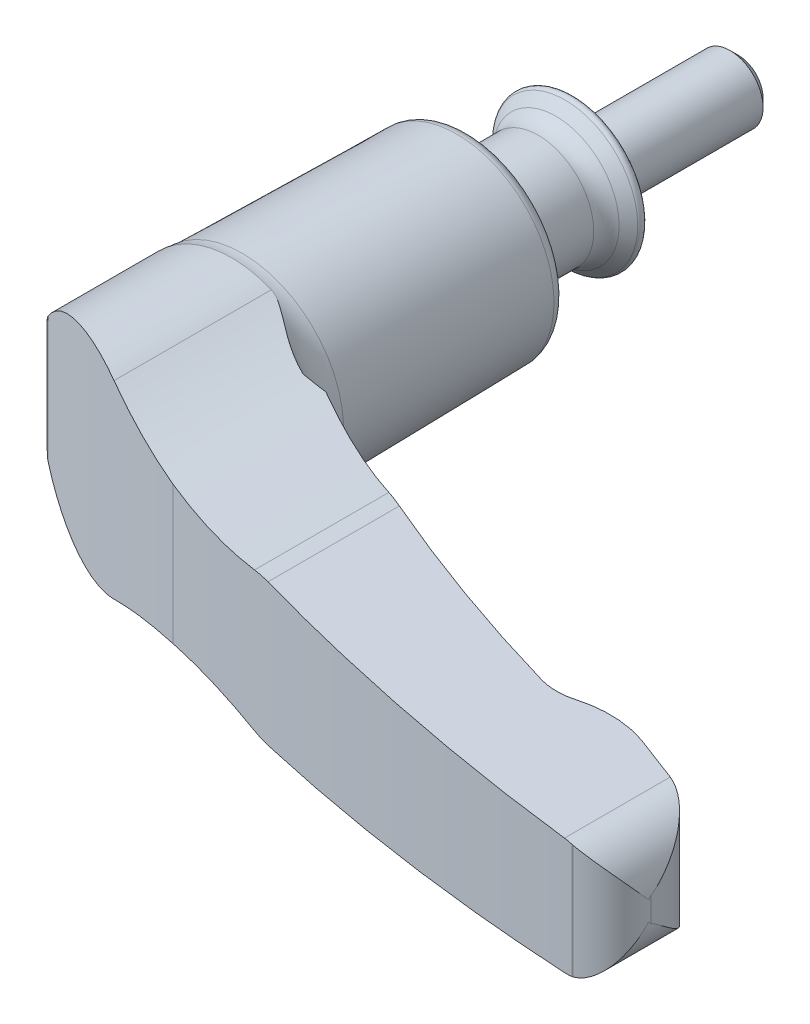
ISO-10303-21;
HEADER;
FILE_DESCRIPTION(('STEP AP214'),'2;1');
FILE_NAME('part.step','',(''),(''),'','','');
FILE_SCHEMA(('AUTOMOTIVE_DESIGN { 1 0 10303 214 1 1 1 1 }'));
ENDSEC;
DATA;
#1=APPLICATION_CONTEXT('core data for automotive mechanical design processes');
#2=APPLICATION_PROTOCOL_DEFINITION('international standard','automotive_design',2000,#1);
#3=PRODUCT_CONTEXT('',#1,'mechanical');
#4=PRODUCT('Part','Part','',(#3));
#5=PRODUCT_RELATED_PRODUCT_CATEGORY('part','',(#4));
#6=PRODUCT_DEFINITION_FORMATION('','',#4);
#7=PRODUCT_DEFINITION_CONTEXT('part definition',#1,'design');
#8=PRODUCT_DEFINITION('design','',#6,#7);
#9=PRODUCT_DEFINITION_SHAPE('','',#8);
#10=(LENGTH_UNIT() NAMED_UNIT(*) SI_UNIT(.MILLI.,.METRE.));
#11=(NAMED_UNIT(*) PLANE_ANGLE_UNIT() SI_UNIT($,.RADIAN.));
#12=(NAMED_UNIT(*) SI_UNIT($,.STERADIAN.) SOLID_ANGLE_UNIT());
#13=UNCERTAINTY_MEASURE_WITH_UNIT(LENGTH_MEASURE(1.E-05),#10,'distance_accuracy_value','');
#14=(GEOMETRIC_REPRESENTATION_CONTEXT(3) GLOBAL_UNCERTAINTY_ASSIGNED_CONTEXT((#13)) GLOBAL_UNIT_ASSIGNED_CONTEXT((#10,
#11,#12)) REPRESENTATION_CONTEXT('',''));
#15=CARTESIAN_POINT('',(0.,0.,0.));
#16=DIRECTION('',(0.,0.,1.));
#17=DIRECTION('',(1.,0.,0.));
#18=AXIS2_PLACEMENT_3D('',#15,#16,#17);
#19=CARTESIAN_POINT('',(-12.2494442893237,-13.45,40.2250875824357));
#20=DIRECTION('',(0.,0.,1.));
#21=DIRECTION('',(-1.,0.,0.));
#22=AXIS2_PLACEMENT_3D('',#19,#20,#21);
#23=PLANE('',#22);
#24=DIRECTION('',(0.,1.,0.));
#25=VECTOR('',#24,1.);
#26=CARTESIAN_POINT('',(-12.2494442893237,-13.45,40.2250875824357));
#27=LINE('',#26,#25);
#28=CARTESIAN_POINT('',(-12.2494442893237,-1.12726551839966,40.2250875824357));
#29=VERTEX_POINT('',#28);
#30=CARTESIAN_POINT('',(-12.2494442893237,0.,40.2250875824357));
#31=VERTEX_POINT('',#30);
#32=EDGE_CURVE('E175',#29,#31,#27,.T.);
#33=ORIENTED_EDGE('',*,*,#32,.T.);
#34=CARTESIAN_POINT('',(-1.62642046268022E-13,0.,40.2250875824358));
#35=DIRECTION('',(0.,0.,1.));
#36=DIRECTION('',(-1.,0.,0.));
#37=AXIS2_PLACEMENT_3D('',#34,#35,#36);
#38=CIRCLE('',#37,12.2494442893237);
#39=EDGE_CURVE('E178',#31,#31,#38,.F.);
#40=ORIENTED_EDGE('',*,*,#39,.F.);
#41=CARTESIAN_POINT('',(-12.2494442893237,1.12726551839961,40.2250875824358));
#42=VERTEX_POINT('',#41);
#43=EDGE_CURVE('E185',#31,#42,#27,.T.);
#44=ORIENTED_EDGE('',*,*,#43,.T.);
#45=CARTESIAN_POINT('',(0.,0.,40.2250875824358));
#46=DIRECTION('',(0.,0.,-1.));
#47=DIRECTION('',(1.,0.,0.));
#48=AXIS2_PLACEMENT_3D('',#45,#46,#47);
#49=CIRCLE('',#48,12.3012037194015);
#50=EDGE_CURVE('E180',#42,#29,#49,.T.);
#51=ORIENTED_EDGE('',*,*,#50,.T.);
#52=EDGE_LOOP('',(#33,#40,#44,#51));
#53=FACE_BOUND('',#52,.T.);
#54=ADVANCED_FACE('F14',(#53),#23,.F.);
#55=CARTESIAN_POINT('',(-12.3990914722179,-13.45,48.8947231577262));
#56=DIRECTION('',(0.999851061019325,0.,0.0172584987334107));
#57=DIRECTION('',(-0.0172584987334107,0.,0.999851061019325));
#58=AXIS2_PLACEMENT_3D('',#55,#56,#57);
#59=PLANE('',#58);
#60=ORIENTED_EDGE('',*,*,#43,.F.);
#61=ORIENTED_EDGE('',*,*,#32,.F.);
#62=CARTESIAN_POINT('',(-12.2494408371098,-1.12726105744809,40.2248875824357));
#63=CARTESIAN_POINT('',(-12.2501546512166,-1.12801102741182,40.2662415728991));
#64=CARTESIAN_POINT('',(-12.2508608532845,-1.13338949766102,40.3071545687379));
#65=CARTESIAN_POINT('',(-12.2522296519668,-1.15131266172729,40.3864543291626));
#66=CARTESIAN_POINT('',(-12.2528928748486,-1.16369170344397,40.4248773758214));
#67=CARTESIAN_POINT('',(-12.254538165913,-1.20206398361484,40.520195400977));
#68=CARTESIAN_POINT('',(-12.255493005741,-1.23180007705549,40.575512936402));
#69=CARTESIAN_POINT('',(-12.257344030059,-1.29909643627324,40.6827498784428));
#70=CARTESIAN_POINT('',(-12.2582382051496,-1.33683049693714,40.7345528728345));
#71=CARTESIAN_POINT('',(-12.2604895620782,-1.44052319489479,40.8649826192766));
#72=CARTESIAN_POINT('',(-12.2618006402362,-1.50977612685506,40.9409384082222));
#73=CARTESIAN_POINT('',(-12.264338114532,-1.65349391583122,41.0879440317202));
#74=CARTESIAN_POINT('',(-12.2655642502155,-1.72797350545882,41.1589787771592));
#75=CARTESIAN_POINT('',(-12.2678450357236,-1.87254522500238,41.2911134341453));
#76=CARTESIAN_POINT('',(-12.268904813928,-1.94236687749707,41.3525104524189));
#77=CARTESIAN_POINT('',(-12.2709847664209,-2.08326818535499,41.4730100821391));
#78=CARTESIAN_POINT('',(-12.2720051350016,-2.15433817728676,41.5321239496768));
#79=CARTESIAN_POINT('',(-12.2730148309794,-2.22587171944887,41.5906195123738));
#80=B_SPLINE_CURVE_WITH_KNOTS('',3,(#62,#63,#64,#65,#66,#67,#68,#69,#70,#71,#72,#73,#74,#75,#76,
#77,#78,#79),.UNSPECIFIED.,.F.,.F.,(4,2,2,2,2,2,2,2,4),(0.,0.123330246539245,0.243857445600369,
0.431247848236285,0.623227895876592,0.931023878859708,1.23972530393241,1.51862793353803,
1.79591047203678),.UNSPECIFIED.);
#81=CARTESIAN_POINT('',(-12.271249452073,-2.10212675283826,41.4883443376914));
#82=VERTEX_POINT('',#81);
#83=EDGE_CURVE('E399',#29,#82,#80,.T.);
#84=ORIENTED_EDGE('',*,*,#83,.T.);
#85=CARTESIAN_POINT('',(0.,0.,-669.432227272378));
#86=DIRECTION('',(0.999851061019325,0.,0.0172584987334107));
#87=DIRECTION('',(0.0172584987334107,0.,-0.999851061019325));
#88=AXIS2_PLACEMENT_3D('',#85,#86,#87);
#89=ELLIPSE('',#88,721.383718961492,12.45);
#90=CARTESIAN_POINT('',(-12.3990914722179,-1.12473581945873,48.8947231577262));
#91=VERTEX_POINT('',#90);
#92=EDGE_CURVE('E239',#82,#91,#89,.F.);
#93=ORIENTED_EDGE('',*,*,#92,.T.);
#94=DIRECTION('',(0.,1.,0.));
#95=VECTOR('',#94,1.);
#96=CARTESIAN_POINT('',(-12.3990914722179,-13.45,48.8947231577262));
#97=LINE('',#96,#95);
#98=CARTESIAN_POINT('',(-12.3990914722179,1.12473581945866,48.8947231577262));
#99=VERTEX_POINT('',#98);
#100=EDGE_CURVE('E184',#91,#99,#97,.T.);
#101=ORIENTED_EDGE('',*,*,#100,.T.);
#102=CARTESIAN_POINT('',(0.,0.,-669.432227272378));
#103=DIRECTION('',(0.999851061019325,0.,0.0172584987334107));
#104=DIRECTION('',(0.0172584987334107,0.,-0.999851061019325));
#105=AXIS2_PLACEMENT_3D('',#102,#103,#104);
#106=ELLIPSE('',#105,721.383718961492,12.45);
#107=CARTESIAN_POINT('',(-12.271249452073,2.10212675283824,41.4883443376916));
#108=VERTEX_POINT('',#107);
#109=EDGE_CURVE('E263',#99,#108,#106,.F.);
#110=ORIENTED_EDGE('',*,*,#109,.T.);
#111=CARTESIAN_POINT('',(-12.2730148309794,2.2258717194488,41.5906195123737));
#112=CARTESIAN_POINT('',(-12.2723484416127,2.17857656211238,41.5520130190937));
#113=CARTESIAN_POINT('',(-12.2716768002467,2.13153645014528,41.5131022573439));
#114=CARTESIAN_POINT('',(-12.2703199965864,2.03804940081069,41.4344974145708));
#115=CARTESIAN_POINT('',(-12.269634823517,1.99160298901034,41.3948027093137));
#116=CARTESIAN_POINT('',(-12.2675030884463,1.84986894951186,41.2713031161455));
#117=CARTESIAN_POINT('',(-12.2660309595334,1.75583214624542,41.1860170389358));
#118=CARTESIAN_POINT('',(-12.2637374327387,1.61936868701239,41.0531442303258));
#119=CARTESIAN_POINT('',(-12.2629577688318,1.574598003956,41.0079753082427));
#120=CARTESIAN_POINT('',(-12.2613598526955,1.48744881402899,40.9154018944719));
#121=CARTESIAN_POINT('',(-12.2605416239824,1.44506888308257,40.8679987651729));
#122=CARTESIAN_POINT('',(-12.2588634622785,1.36463549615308,40.7707764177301));
#123=CARTESIAN_POINT('',(-12.2580043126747,1.32652790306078,40.7210025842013));
#124=CARTESIAN_POINT('',(-12.2562147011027,1.25655247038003,40.6173235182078));
#125=CARTESIAN_POINT('',(-12.2552845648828,1.22465826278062,40.5634371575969));
#126=CARTESIAN_POINT('',(-12.2536883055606,1.18138793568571,40.4709597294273));
#127=CARTESIAN_POINT('',(-12.2530490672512,1.16676743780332,40.4339262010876));
#128=CARTESIAN_POINT('',(-12.2517389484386,1.14385333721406,40.3580259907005));
#129=CARTESIAN_POINT('',(-12.251068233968,1.13552979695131,40.3191689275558));
#130=CARTESIAN_POINT('',(-12.2500751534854,1.12891545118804,40.2616359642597));
#131=CARTESIAN_POINT('',(-12.2497582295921,1.12764004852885,40.2432753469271));
#132=CARTESIAN_POINT('',(-12.2494408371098,1.12726105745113,40.2248875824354));
#133=B_SPLINE_CURVE_WITH_KNOTS('',3,(#111,#112,#113,#114,#115,#116,#117,#118,#119,#120,#121,
#122,#123,#124,#125,#126,#127,#128,#129,#130,#131,#132),.UNSPECIFIED.,.F.,.F.,(4,2,2,2,2,2,2,2,
2,2,4),(0.,0.183152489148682,0.366457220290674,0.747103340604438,0.937859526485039,
1.12850085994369,1.31635856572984,1.50340080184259,1.62247471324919,1.74097889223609,
1.79613687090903),.UNSPECIFIED.);
#134=EDGE_CURVE('E190',#108,#42,#133,.T.);
#135=ORIENTED_EDGE('',*,*,#134,.T.);
#136=EDGE_LOOP('',(#60,#61,#84,#93,#101,#110,#135));
#137=FACE_BOUND('',#136,.T.);
#138=ADVANCED_FACE('F188',(#137),#59,.F.);
#139=CARTESIAN_POINT('',(111.767919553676,-13.45,-139.797819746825));
#140=DIRECTION('',(0.,1.,0.));
#141=DIRECTION('',(-1.,0.,0.));
#142=AXIS2_PLACEMENT_3D('',#139,#140,#141);
#143=CYLINDRICAL_SURFACE('',#142,208.999999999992);
#144=DIRECTION('',(0.,1.,0.));
#145=VECTOR('',#144,1.);
#146=CARTESIAN_POINT('',(15.7999999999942,-13.45,45.8662812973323));
#147=LINE('',#146,#145);
#148=CARTESIAN_POINT('',(15.8,-8.43613014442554,45.8662812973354));
#149=VERTEX_POINT('',#148);
#150=CARTESIAN_POINT('',(15.8,0.,45.8662812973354));
#151=VERTEX_POINT('',#150);
#152=EDGE_CURVE('E191',#149,#151,#147,.T.);
#153=ORIENTED_EDGE('',*,*,#152,.T.);
#154=DIRECTION('',(0.,1.,0.));
#155=VECTOR('',#154,1.);
#156=CARTESIAN_POINT('',(15.8,-13.45,45.8662812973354));
#157=LINE('',#156,#155);
#158=CARTESIAN_POINT('',(15.7999999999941,8.43613014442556,45.8662812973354));
#159=VERTEX_POINT('',#158);
#160=EDGE_CURVE('E413',#159,#151,#157,.F.);
#161=ORIENTED_EDGE('',*,*,#160,.F.);
#162=CARTESIAN_POINT('',(15.7999999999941,8.43613014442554,45.8662812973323));
#163=CARTESIAN_POINT('',(16.3870365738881,8.34717375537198,46.1697176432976));
#164=CARTESIAN_POINT('',(16.9767713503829,8.26904045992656,46.4710139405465));
#165=CARTESIAN_POINT('',(18.161091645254,8.13475115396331,47.0689822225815));
#166=CARTESIAN_POINT('',(18.7556773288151,8.07859589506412,47.3656540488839));
#167=CARTESIAN_POINT('',(20.5395968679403,7.94407204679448,48.2451118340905));
#168=CARTESIAN_POINT('',(21.7352391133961,7.89871013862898,48.8205177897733));
#169=CARTESIAN_POINT('',(24.1374209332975,7.89893976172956,49.9484747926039));
#170=CARTESIAN_POINT('',(25.3439611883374,7.94453701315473,50.5010244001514));
#171=CARTESIAN_POINT('',(27.1599173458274,8.0830634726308,51.3119106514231));
#172=CARTESIAN_POINT('',(27.7678474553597,8.14117035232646,51.5798888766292));
#173=CARTESIAN_POINT('',(28.9839481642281,8.28117670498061,52.1090693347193));
#174=CARTESIAN_POINT('',(29.5921187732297,8.36307725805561,52.370271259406));
#175=CARTESIAN_POINT('',(30.2000000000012,8.45699782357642,52.6279438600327));
#176=B_SPLINE_CURVE_WITH_KNOTS('',3,(#162,#163,#164,#165,#166,#167,#168,#169,#170,#171,#172,
#173,#174,#175),.UNSPECIFIED.,.F.,.F.,(4,2,2,2,2,2,4),(0.,2.00016069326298,4.00038978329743,
7.97994863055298,11.9597577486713,13.9600808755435,15.9604948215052),.UNSPECIFIED.);
#177=CARTESIAN_POINT('',(30.2000000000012,8.45699782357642,52.6279438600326));
#178=VERTEX_POINT('',#177);
#179=EDGE_CURVE('E264',#159,#178,#176,.T.);
#180=ORIENTED_EDGE('',*,*,#179,.T.);
#181=CARTESIAN_POINT('',(32.4002231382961,8.59297245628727,53.5458348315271));
#182=CARTESIAN_POINT('',(32.2157966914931,8.59945246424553,53.4701291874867));
#183=CARTESIAN_POINT('',(32.0313583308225,8.60144694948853,53.3941076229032));
#184=CARTESIAN_POINT('',(31.6631700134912,8.59650662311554,53.2417318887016));
#185=CARTESIAN_POINT('',(31.4794194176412,8.58958963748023,53.1653786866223));
#186=CARTESIAN_POINT('',(30.9288846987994,8.55552869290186,52.9356990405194));
#187=CARTESIAN_POINT('',(30.5630943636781,8.51506518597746,52.7818661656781));
#188=CARTESIAN_POINT('',(30.2000000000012,8.45699782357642,52.6279438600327));
#189=B_SPLINE_CURVE_WITH_KNOTS('',3,(#181,#182,#183,#184,#185,#186,#187,#188),.UNSPECIFIED.,.F.,
.F.,(4,2,2,4),(0.,0.598316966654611,1.19543895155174,2.3905773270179),.UNSPECIFIED.);
#190=CARTESIAN_POINT('',(32.4002231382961,8.59297245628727,53.5458348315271));
#191=VERTEX_POINT('',#190);
#192=EDGE_CURVE('E342',#191,#178,#189,.T.);
#193=ORIENTED_EDGE('',*,*,#192,.F.);
#194=CARTESIAN_POINT('',(111.767919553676,5.80486876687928,-139.797819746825));
#195=DIRECTION('',(-0.0351072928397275,-0.999383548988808,0.));
#196=DIRECTION('',(-0.999383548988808,0.0351072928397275,0.));
#197=AXIS2_PLACEMENT_3D('',#194,#195,#196);
#198=ELLIPSE('',#197,209.128917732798,208.999999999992);
#199=CARTESIAN_POINT('',(58.4999999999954,7.67611474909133,62.2999999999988));
#200=VERTEX_POINT('',#199);
#201=EDGE_CURVE('E350',#200,#191,#198,.T.);
#202=ORIENTED_EDGE('',*,*,#201,.F.);
#203=DIRECTION('',(0.,1.,0.));
#204=VECTOR('',#203,1.);
#205=CARTESIAN_POINT('',(58.4999999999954,-13.45,62.2999999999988));
#206=LINE('',#205,#204);
#207=CARTESIAN_POINT('',(58.4999999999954,-7.67611474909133,62.2999999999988));
#208=VERTEX_POINT('',#207);
#209=EDGE_CURVE('E193',#208,#200,#206,.T.);
#210=ORIENTED_EDGE('',*,*,#209,.F.);
#211=CARTESIAN_POINT('',(111.767919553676,-5.80486876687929,-139.797819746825));
#212=DIRECTION('',(-0.0351072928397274,0.999383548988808,0.));
#213=DIRECTION('',(0.999383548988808,0.0351072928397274,0.));
#214=AXIS2_PLACEMENT_3D('',#211,#212,#213);
#215=ELLIPSE('',#214,209.128917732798,208.999999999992);
#216=CARTESIAN_POINT('',(32.4002231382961,-8.59297245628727,53.5458348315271));
#217=VERTEX_POINT('',#216);
#218=EDGE_CURVE('E817',#217,#208,#215,.T.);
#219=ORIENTED_EDGE('',*,*,#218,.F.);
#220=CARTESIAN_POINT('',(30.2000000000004,-8.45699782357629,52.6279438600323));
#221=CARTESIAN_POINT('',(30.5630943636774,-8.51506518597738,52.7818661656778));
#222=CARTESIAN_POINT('',(30.9288846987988,-8.55552869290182,52.9356990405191));
#223=CARTESIAN_POINT('',(31.4794194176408,-8.58958963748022,53.1653786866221));
#224=CARTESIAN_POINT('',(31.6631700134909,-8.59650662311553,53.2417318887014));
#225=CARTESIAN_POINT('',(32.0313583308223,-8.60144694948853,53.3941076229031));
#226=CARTESIAN_POINT('',(32.215796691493,-8.59945246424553,53.4701291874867));
#227=CARTESIAN_POINT('',(32.4002231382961,-8.59297245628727,53.5458348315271));
#228=B_SPLINE_CURVE_WITH_KNOTS('',3,(#220,#221,#222,#223,#224,#225,#226,#227),.UNSPECIFIED.,.F.,
.F.,(4,2,2,4),(0.,1.19513837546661,1.79226036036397,2.39057732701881),.UNSPECIFIED.);
#229=CARTESIAN_POINT('',(30.2000000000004,-8.45699782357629,52.6279438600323));
#230=VERTEX_POINT('',#229);
#231=EDGE_CURVE('E317',#230,#217,#228,.T.);
#232=ORIENTED_EDGE('',*,*,#231,.F.);
#233=CARTESIAN_POINT('',(30.2,-8.45699782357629,52.6279438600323));
#234=CARTESIAN_POINT('',(29.5921187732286,-8.36307725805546,52.3702712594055));
#235=CARTESIAN_POINT('',(28.983948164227,-8.28117670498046,52.1090693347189));
#236=CARTESIAN_POINT('',(27.7678474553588,-8.14117035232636,51.5798888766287));
#237=CARTESIAN_POINT('',(27.1599173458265,-8.08306347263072,51.3119106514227));
#238=CARTESIAN_POINT('',(25.3439611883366,-7.94453701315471,50.5010244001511));
#239=CARTESIAN_POINT('',(24.1374209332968,-7.89893976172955,49.9484747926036));
#240=CARTESIAN_POINT('',(21.7352391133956,-7.89871013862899,48.820517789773));
#241=CARTESIAN_POINT('',(20.5395968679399,-7.9440720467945,48.2451118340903));
#242=CARTESIAN_POINT('',(18.7556773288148,-8.07859589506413,47.3656540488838));
#243=CARTESIAN_POINT('',(18.1610916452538,-8.13475115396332,47.0689822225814));
#244=CARTESIAN_POINT('',(16.9767713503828,-8.26904045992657,46.4710139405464));
#245=CARTESIAN_POINT('',(16.387036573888,-8.34717375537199,46.1697176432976));
#246=CARTESIAN_POINT('',(15.7999999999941,-8.43613014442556,45.8662812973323));
#247=B_SPLINE_CURVE_WITH_KNOTS('',3,(#233,#234,#235,#236,#237,#238,#239,#240,#241,#242,#243,
#244,#245,#246),.UNSPECIFIED.,.F.,.F.,(4,2,2,2,2,2,4),(0.,2.00041394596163,4.00073707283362,
7.98054619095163,11.9601050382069,13.9603341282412,15.960494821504),.UNSPECIFIED.);
#248=EDGE_CURVE('E335',#230,#149,#247,.T.);
#249=ORIENTED_EDGE('',*,*,#248,.T.);
#250=EDGE_LOOP('',(#153,#161,#180,#193,#202,#210,#219,#232,#249));
#251=FACE_BOUND('',#250,.T.);
#252=ADVANCED_FACE('F325',(#251),#143,.F.);
#253=CARTESIAN_POINT('',(76.9,-13.45,77.));
#254=DIRECTION('',(0.,0.,-1.));
#255=DIRECTION('',(0.,1.,0.));
#256=AXIS2_PLACEMENT_3D('',#253,#254,#255);
#257=PLANE('',#256);
#258=DIRECTION('',(0.,1.,0.));
#259=VECTOR('',#258,1.);
#260=CARTESIAN_POINT('',(76.9,-13.45,77.));
#261=LINE('',#260,#259);
#262=CARTESIAN_POINT('',(76.9,-6.92676825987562,77.));
#263=VERTEX_POINT('',#262);
#264=CARTESIAN_POINT('',(76.9,6.92676825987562,77.));
#265=VERTEX_POINT('',#264);
#266=EDGE_CURVE('E790',#263,#265,#261,.T.);
#267=ORIENTED_EDGE('',*,*,#266,.T.);
#268=CARTESIAN_POINT('',(75.6,1.17177043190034,77.));
#269=DIRECTION('',(0.,0.,-1.));
#270=DIRECTION('',(0.,1.,0.));
#271=AXIS2_PLACEMENT_3D('',#268,#269,#270);
#272=CIRCLE('',#271,5.9);
#273=CARTESIAN_POINT('',(76.8,6.94844767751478,77.));
#274=VERTEX_POINT('',#273);
#275=EDGE_CURVE('E860',#265,#274,#272,.F.);
#276=ORIENTED_EDGE('',*,*,#275,.T.);
#277=DIRECTION('',(0.,1.,0.));
#278=VECTOR('',#277,1.);
#279=CARTESIAN_POINT('',(76.8,-13.45,77.));
#280=LINE('',#279,#278);
#281=CARTESIAN_POINT('',(76.8,-6.94844767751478,77.));
#282=VERTEX_POINT('',#281);
#283=EDGE_CURVE('E788',#282,#274,#280,.T.);
#284=ORIENTED_EDGE('',*,*,#283,.F.);
#285=CARTESIAN_POINT('',(75.6,-1.17177043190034,77.));
#286=DIRECTION('',(0.,0.,-1.));
#287=DIRECTION('',(0.,1.,0.));
#288=AXIS2_PLACEMENT_3D('',#285,#286,#287);
#289=CIRCLE('',#288,5.9);
#290=EDGE_CURVE('E903',#282,#263,#289,.F.);
#291=ORIENTED_EDGE('',*,*,#290,.T.);
#292=EDGE_LOOP('',(#267,#276,#284,#291));
#293=FACE_BOUND('',#292,.T.);
#294=ADVANCED_FACE('F329',(#293),#257,.F.);
#295=CARTESIAN_POINT('',(99.3774025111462,-13.45,-191.753327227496));
#296=DIRECTION('',(0.,1.,0.));
#297=DIRECTION('',(-1.,0.,0.));
#298=AXIS2_PLACEMENT_3D('',#295,#296,#297);
#299=CYLINDRICAL_SURFACE('',#298,269.7);
#300=CARTESIAN_POINT('',(16.1999999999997,8.37725139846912,64.8));
#301=CARTESIAN_POINT('',(16.7767031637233,8.29486390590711,64.9869756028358));
#302=CARTESIAN_POINT('',(17.3553557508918,8.22300064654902,65.1724296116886));
#303=CARTESIAN_POINT('',(18.5159500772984,8.10050516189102,65.5400576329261));
#304=CARTESIAN_POINT('',(19.0978918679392,8.04987326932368,65.7222315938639));
#305=CARTESIAN_POINT('',(20.8414876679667,7.93052773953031,66.2615450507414));
#306=CARTESIAN_POINT('',(22.0070770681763,7.89348273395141,66.6134754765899));
#307=CARTESIAN_POINT('',(24.3425845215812,7.90540743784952,67.3013928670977));
#308=CARTESIAN_POINT('',(25.512502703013,7.95437971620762,67.6373793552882));
#309=CARTESIAN_POINT('',(27.2687809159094,8.09314767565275,68.1289718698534));
#310=CARTESIAN_POINT('',(27.8560018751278,8.15052863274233,68.2911856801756));
#311=CARTESIAN_POINT('',(29.0291528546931,8.28726693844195,68.611001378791));
#312=CARTESIAN_POINT('',(29.6150828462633,8.36662477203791,68.7686031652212));
#313=CARTESIAN_POINT('',(30.2000000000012,8.45699782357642,68.9238236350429));
#314=B_SPLINE_CURVE_WITH_KNOTS('',3,(#300,#301,#302,#303,#304,#305,#306,#307,#308,#309,#310,
#311,#312,#313),.UNSPECIFIED.,.F.,.F.,(4,2,2,2,2,2,4),(0.,1.83529834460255,3.6706254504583,
7.32170279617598,10.9728891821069,12.808257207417,14.6436657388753),.UNSPECIFIED.);
#315=CARTESIAN_POINT('',(16.1999999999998,8.37725139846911,64.8));
#316=VERTEX_POINT('',#315);
#317=CARTESIAN_POINT('',(30.2000000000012,8.45699782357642,68.9238236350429));
#318=VERTEX_POINT('',#317);
#319=EDGE_CURVE('E775',#316,#318,#314,.T.);
#320=ORIENTED_EDGE('',*,*,#319,.F.);
#321=DIRECTION('',(0.,1.,0.));
#322=VECTOR('',#321,1.);
#323=CARTESIAN_POINT('',(16.1999999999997,-13.45,64.8));
#324=LINE('',#323,#322);
#325=CARTESIAN_POINT('',(16.1999999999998,-8.37725139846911,64.8));
#326=VERTEX_POINT('',#325);
#327=EDGE_CURVE('E349',#326,#316,#324,.T.);
#328=ORIENTED_EDGE('',*,*,#327,.F.);
#329=CARTESIAN_POINT('',(30.2,-8.45699782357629,68.9238236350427));
#330=CARTESIAN_POINT('',(29.6150828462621,-8.36662477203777,68.7686031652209));
#331=CARTESIAN_POINT('',(29.029152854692,-8.28726693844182,68.6110013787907));
#332=CARTESIAN_POINT('',(27.8560018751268,-8.15052863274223,68.2911856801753));
#333=CARTESIAN_POINT('',(27.2687809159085,-8.09314767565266,68.1289718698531));
#334=CARTESIAN_POINT('',(25.5125027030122,-7.95437971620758,67.637379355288));
#335=CARTESIAN_POINT('',(24.3425845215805,-7.9054074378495,67.3013928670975));
#336=CARTESIAN_POINT('',(22.0070770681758,-7.89348273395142,66.6134754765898));
#337=CARTESIAN_POINT('',(20.8414876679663,-7.93052773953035,66.2615450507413));
#338=CARTESIAN_POINT('',(19.097891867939,-8.0498732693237,65.7222315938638));
#339=CARTESIAN_POINT('',(18.5159500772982,-8.10050516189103,65.540057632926));
#340=CARTESIAN_POINT('',(17.3553557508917,-8.22300064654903,65.1724296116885));
#341=CARTESIAN_POINT('',(16.7767031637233,-8.29486390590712,64.9869756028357));
#342=CARTESIAN_POINT('',(16.1999999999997,-8.37725139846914,64.8));
#343=B_SPLINE_CURVE_WITH_KNOTS('',3,(#329,#330,#331,#332,#333,#334,#335,#336,#337,#338,#339,
#340,#341,#342),.UNSPECIFIED.,.F.,.F.,(4,2,2,2,2,2,4),(0.,1.83540853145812,3.67077655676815,
7.32196294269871,10.9730402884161,12.8083673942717,14.6436657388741),.UNSPECIFIED.);
#344=CARTESIAN_POINT('',(30.2000000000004,-8.45699782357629,68.9238236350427));
#345=VERTEX_POINT('',#344);
#346=EDGE_CURVE('E446',#345,#326,#343,.T.);
#347=ORIENTED_EDGE('',*,*,#346,.F.);
#348=CARTESIAN_POINT('',(30.2000000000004,-8.45699782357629,68.9238236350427));
#349=CARTESIAN_POINT('',(30.5632894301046,-8.51510955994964,69.0202386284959));
#350=CARTESIAN_POINT('',(30.9292671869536,-8.55556829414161,69.1165394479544));
#351=CARTESIAN_POINT('',(31.4798508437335,-8.58960835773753,69.2601745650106));
#352=CARTESIAN_POINT('',(31.6635722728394,-8.5965163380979,69.3078974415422));
#353=CARTESIAN_POINT('',(32.0316308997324,-8.60144626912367,69.4030885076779));
#354=CARTESIAN_POINT('',(32.21596856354,-8.59944866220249,69.4505559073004));
#355=CARTESIAN_POINT('',(32.4002231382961,-8.59297245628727,69.4977922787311));
#356=B_SPLINE_CURVE_WITH_KNOTS('',3,(#348,#349,#350,#351,#352,#353,#354,#355),.UNSPECIFIED.,.F.,
.F.,(4,2,2,4),(0.,1.14021168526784,1.70984874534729,2.2807374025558),.UNSPECIFIED.);
#357=CARTESIAN_POINT('',(32.4002231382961,-8.59297245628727,69.497792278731));
#358=VERTEX_POINT('',#357);
#359=EDGE_CURVE('E292',#345,#358,#356,.T.);
#360=ORIENTED_EDGE('',*,*,#359,.T.);
#361=CARTESIAN_POINT('',(99.3774025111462,-6.24013459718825,-191.753327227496));
#362=DIRECTION('',(-0.0351072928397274,0.999383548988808,0.));
#363=DIRECTION('',(0.999383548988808,0.0351072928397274,0.));
#364=AXIS2_PLACEMENT_3D('',#361,#362,#363);
#365=ELLIPSE('',#364,269.866359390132,269.7);
#366=CARTESIAN_POINT('',(75.8071330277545,-7.06813337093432,76.9147438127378));
#367=VERTEX_POINT('',#366);
#368=EDGE_CURVE('E304',#358,#367,#365,.T.);
#369=ORIENTED_EDGE('',*,*,#368,.T.);
#370=CARTESIAN_POINT('',(75.8071330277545,-7.06813337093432,76.9147438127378));
#371=CARTESIAN_POINT('',(75.9742663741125,-7.06223993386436,76.929403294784));
#372=CARTESIAN_POINT('',(76.1405719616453,-7.04931940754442,76.943837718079));
#373=CARTESIAN_POINT('',(76.4715276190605,-7.00942417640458,76.9722564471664));
#374=CARTESIAN_POINT('',(76.6361776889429,-6.98244947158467,76.9862407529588));
#375=CARTESIAN_POINT('',(76.8,-6.94844767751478,77.));
#376=B_SPLINE_CURVE_WITH_KNOTS('',3,(#370,#371,#372,#373,#374,#375),.UNSPECIFIED.,.F.,.F.,(4,2,
4),(0.,0.50229032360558,1.00458064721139),.UNSPECIFIED.);
#377=EDGE_CURVE('E905',#367,#282,#376,.T.);
#378=ORIENTED_EDGE('',*,*,#377,.T.);
#379=ORIENTED_EDGE('',*,*,#283,.T.);
#380=CARTESIAN_POINT('',(76.8,6.94844767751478,77.));
#381=CARTESIAN_POINT('',(76.6361776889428,6.98244947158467,76.9862407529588));
#382=CARTESIAN_POINT('',(76.4715276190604,7.00942417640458,76.9722564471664));
#383=CARTESIAN_POINT('',(76.1405719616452,7.04931940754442,76.943837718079));
#384=CARTESIAN_POINT('',(75.9742663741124,7.06223993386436,76.929403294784));
#385=CARTESIAN_POINT('',(75.8071330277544,7.06813337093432,76.9147438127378));
#386=B_SPLINE_CURVE_WITH_KNOTS('',3,(#380,#381,#382,#383,#384,#385),.UNSPECIFIED.,.F.,.F.,(4,2,
4),(0.,0.502290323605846,1.00458064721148),.UNSPECIFIED.);
#387=CARTESIAN_POINT('',(75.8071330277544,7.06813337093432,76.9147438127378));
#388=VERTEX_POINT('',#387);
#389=EDGE_CURVE('E847',#274,#388,#386,.T.);
#390=ORIENTED_EDGE('',*,*,#389,.T.);
#391=CARTESIAN_POINT('',(99.3774025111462,6.24013459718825,-191.753327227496));
#392=DIRECTION('',(-0.0351072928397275,-0.999383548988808,0.));
#393=DIRECTION('',(-0.999383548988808,0.0351072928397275,0.));
#394=AXIS2_PLACEMENT_3D('',#391,#392,#393);
#395=ELLIPSE('',#394,269.866359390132,269.7);
#396=CARTESIAN_POINT('',(32.4002231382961,8.59297245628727,69.497792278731));
#397=VERTEX_POINT('',#396);
#398=EDGE_CURVE('E372',#388,#397,#395,.T.);
#399=ORIENTED_EDGE('',*,*,#398,.T.);
#400=CARTESIAN_POINT('',(32.4002231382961,8.59297245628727,69.497792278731));
#401=CARTESIAN_POINT('',(32.2159685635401,8.59944866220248,69.4505559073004));
#402=CARTESIAN_POINT('',(32.0316308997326,8.60144626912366,69.4030885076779));
#403=CARTESIAN_POINT('',(31.6635722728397,8.5965163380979,69.3078974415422));
#404=CARTESIAN_POINT('',(31.4798508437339,8.58960835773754,69.2601745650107));
#405=CARTESIAN_POINT('',(30.9292671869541,8.55556829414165,69.1165394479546));
#406=CARTESIAN_POINT('',(30.5632894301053,8.51510955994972,69.0202386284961));
#407=CARTESIAN_POINT('',(30.2000000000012,8.45699782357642,68.9238236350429));
#408=B_SPLINE_CURVE_WITH_KNOTS('',3,(#400,#401,#402,#403,#404,#405,#406,#407),.UNSPECIFIED.,.F.,
.F.,(4,2,2,4),(0.,0.5708886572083,1.14052571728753,2.28073740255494),.UNSPECIFIED.);
#409=EDGE_CURVE('E363',#397,#318,#408,.T.);
#410=ORIENTED_EDGE('',*,*,#409,.T.);
#411=EDGE_LOOP('',(#320,#328,#347,#360,#369,#378,#379,#390,#399,#410));
#412=FACE_BOUND('',#411,.T.);
#413=ADVANCED_FACE('F306',(#412),#299,.T.);
#414=CARTESIAN_POINT('',(79.8840849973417,-13.45,-124.78991881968));
#415=DIRECTION('',(0.,1.,0.));
#416=DIRECTION('',(-1.,0.,0.));
#417=AXIS2_PLACEMENT_3D('',#414,#415,#416);
#418=CYLINDRICAL_SURFACE('',#417,200.000000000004);
#419=DIRECTION('',(0.,1.,0.));
#420=VECTOR('',#419,1.);
#421=CARTESIAN_POINT('',(-9.90000000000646,-13.45,53.9244289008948));
#422=LINE('',#421,#420);
#423=CARTESIAN_POINT('',(-9.90000000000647,-7.54933771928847,53.9244289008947));
#424=VERTEX_POINT('',#423);
#425=CARTESIAN_POINT('',(-9.90000000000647,7.54933771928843,53.9244289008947));
#426=VERTEX_POINT('',#425);
#427=EDGE_CURVE('E199',#424,#426,#422,.T.);
#428=ORIENTED_EDGE('',*,*,#427,.F.);
#429=CARTESIAN_POINT('',(-9.90000000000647,-7.54933771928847,53.9244289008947));
#430=CARTESIAN_POINT('',(-9.67451817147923,-7.84507120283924,54.0377127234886));
#431=CARTESIAN_POINT('',(-9.4368447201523,-8.12923310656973,54.1565790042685));
#432=CARTESIAN_POINT('',(-8.93966759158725,-8.67296304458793,54.403880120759));
#433=CARTESIAN_POINT('',(-8.68017587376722,-8.93254438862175,54.5323097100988));
#434=CARTESIAN_POINT('',(-8.14219185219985,-9.42550410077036,54.7970082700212));
#435=CARTESIAN_POINT('',(-7.86373776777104,-9.65893280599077,54.9332613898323));
#436=CARTESIAN_POINT('',(-7.28965149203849,-10.0992248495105,55.2124187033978));
#437=CARTESIAN_POINT('',(-6.994017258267,-10.3060850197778,55.3553236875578));
#438=CARTESIAN_POINT('',(-6.38843577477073,-10.6920089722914,55.6461218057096));
#439=CARTESIAN_POINT('',(-6.07851806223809,-10.8711270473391,55.7940044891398));
#440=CARTESIAN_POINT('',(-5.44596700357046,-11.2013953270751,56.0937585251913));
#441=CARTESIAN_POINT('',(-5.12333306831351,-11.3525442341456,56.2456300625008));
#442=CARTESIAN_POINT('',(-4.46756903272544,-11.6262415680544,56.5521043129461));
#443=CARTESIAN_POINT('',(-4.13444284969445,-11.7488005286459,56.7067059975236));
#444=CARTESIAN_POINT('',(-3.45976822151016,-11.9648655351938,57.0175072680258));
#445=CARTESIAN_POINT('',(-3.11822142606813,-12.0583772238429,57.1737065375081));
#446=CARTESIAN_POINT('',(-2.31903314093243,-12.2409805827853,57.5364253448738));
#447=CARTESIAN_POINT('',(-1.85895294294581,-12.3192478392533,57.743179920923));
#448=CARTESIAN_POINT('',(-1.16440659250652,-12.3976193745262,58.0521070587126));
#449=CARTESIAN_POINT('',(-0.932215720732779,-12.4172382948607,58.1548548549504));
#450=CARTESIAN_POINT('',(-0.466758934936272,-12.443430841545,58.3597645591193));
#451=CARTESIAN_POINT('',(-0.233492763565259,-12.4500011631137,58.4619263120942));
#452=CARTESIAN_POINT('',(0.405450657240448,-12.4499979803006,58.7403022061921));
#453=CARTESIAN_POINT('',(0.811584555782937,-12.4301810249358,58.9156432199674));
#454=CARTESIAN_POINT('',(1.62179032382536,-12.3506318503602,59.2622685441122));
#455=CARTESIAN_POINT('',(2.02586144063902,-12.2908859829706,59.4335514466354));
#456=CARTESIAN_POINT('',(2.83079805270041,-12.1308842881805,59.7716755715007));
#457=CARTESIAN_POINT('',(3.23162970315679,-12.030387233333,59.9384839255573));
#458=CARTESIAN_POINT('',(4.02384464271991,-11.7891025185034,60.2652335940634));
#459=CARTESIAN_POINT('',(4.41522782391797,-11.6483143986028,60.4251748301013));
#460=CARTESIAN_POINT('',(4.79999999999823,-11.4874931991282,60.5810071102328));
#461=B_SPLINE_CURVE_WITH_KNOTS('',3,(#429,#430,#431,#432,#433,#434,#435,#436,#437,#438,#439,
#440,#441,#442,#443,#444,#445,#446,#447,#448,#449,#450,#451,#452,#453,#454,#455,#456,#457,#458,
#459,#460),.UNSPECIFIED.,.F.,.F.,(4,2,2,2,2,2,2,2,2,2,2,2,2,2,2,4),(0.,1.16572536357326,
2.33081586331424,3.49362387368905,4.65657040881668,5.81721142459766,6.97790627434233,
8.1381727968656,9.29821378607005,10.8264676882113,11.5901890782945,12.3541038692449,
13.6806107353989,15.007571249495,16.3425041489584,17.67745228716),.UNSPECIFIED.);
#462=CARTESIAN_POINT('',(4.79999999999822,-11.4874931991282,60.5810071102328));
#463=VERTEX_POINT('',#462);
#464=EDGE_CURVE('E202',#424,#463,#461,.T.);
#465=ORIENTED_EDGE('',*,*,#464,.T.);
#466=CARTESIAN_POINT('',(16.1999999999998,-8.37725139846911,64.8));
#467=CARTESIAN_POINT('',(15.21368787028,-8.51813618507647,64.4687294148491));
#468=CARTESIAN_POINT('',(14.2339762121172,-8.68971619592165,64.1310391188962));
#469=CARTESIAN_POINT('',(12.2943158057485,-9.09213654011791,63.4457683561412));
#470=CARTESIAN_POINT('',(11.3343097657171,-9.32276678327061,63.0982267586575));
#471=CARTESIAN_POINT('',(9.43367460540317,-9.8421618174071,62.3938598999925));
#472=CARTESIAN_POINT('',(8.49304509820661,-10.1309254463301,62.0370348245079));
#473=CARTESIAN_POINT('',(6.63069309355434,-10.7662294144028,61.3147410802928));
#474=CARTESIAN_POINT('',(5.70904885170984,-11.1129696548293,60.9492463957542));
#475=CARTESIAN_POINT('',(4.79999999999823,-11.4874931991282,60.5810071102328));
#476=B_SPLINE_CURVE_WITH_KNOTS('',3,(#466,#467,#468,#469,#470,#471,#472,#473,#474,#475),
.UNSPECIFIED.,.F.,.F.,(4,2,2,2,4),(0.,3.14928931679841,6.2875260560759,9.42570006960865,
12.5749263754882),.UNSPECIFIED.);
#477=EDGE_CURVE('E211',#326,#463,#476,.T.);
#478=ORIENTED_EDGE('',*,*,#477,.F.);
#479=ORIENTED_EDGE('',*,*,#327,.T.);
#480=CARTESIAN_POINT('',(4.7999999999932,11.4874931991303,60.5810071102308));
#481=CARTESIAN_POINT('',(5.70904885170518,11.1129696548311,60.9492463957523));
#482=CARTESIAN_POINT('',(6.63069309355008,10.7662294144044,61.3147410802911));
#483=CARTESIAN_POINT('',(8.49304509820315,10.1309254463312,62.0370348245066));
#484=CARTESIAN_POINT('',(9.43367460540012,9.84216181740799,62.3938598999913));
#485=CARTESIAN_POINT('',(11.3343097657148,9.32276678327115,63.0982267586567));
#486=CARTESIAN_POINT('',(12.2943158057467,9.0921365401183,63.4457683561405));
#487=CARTESIAN_POINT('',(14.2339762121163,8.6897161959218,64.1310391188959));
#488=CARTESIAN_POINT('',(15.2136878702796,8.51813618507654,64.4687294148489));
#489=CARTESIAN_POINT('',(16.1999999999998,8.37725139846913,64.8));
#490=B_SPLINE_CURVE_WITH_KNOTS('',3,(#480,#481,#482,#483,#484,#485,#486,#487,#488,#489),
.UNSPECIFIED.,.F.,.F.,(4,2,2,2,4),(0.,3.14922630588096,6.28740031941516,9.42563705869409,
12.574926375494),.UNSPECIFIED.);
#491=CARTESIAN_POINT('',(4.7999999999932,11.4874931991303,60.5810071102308));
#492=VERTEX_POINT('',#491);
#493=EDGE_CURVE('E293',#492,#316,#490,.T.);
#494=ORIENTED_EDGE('',*,*,#493,.F.);
#495=CARTESIAN_POINT('',(4.79999999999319,11.4874931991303,60.5810071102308));
#496=CARTESIAN_POINT('',(4.41580947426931,11.6480694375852,60.425410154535));
#497=CARTESIAN_POINT('',(4.02503382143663,11.7886738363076,60.2657194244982));
#498=CARTESIAN_POINT('',(3.23419246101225,12.0296727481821,59.9395455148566));
#499=CARTESIAN_POINT('',(2.8341300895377,12.1300814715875,59.7730647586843));
#500=CARTESIAN_POINT('',(2.02936760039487,12.2903278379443,59.4350346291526));
#501=CARTESIAN_POINT('',(1.62468227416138,12.3502704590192,59.2634995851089));
#502=CARTESIAN_POINT('',(0.8131282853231,12.4301064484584,58.9163098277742));
#503=CARTESIAN_POINT('',(0.406259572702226,12.4499988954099,58.7406550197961));
#504=CARTESIAN_POINT('',(-0.381370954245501,12.4500010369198,58.3974981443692));
#505=CARTESIAN_POINT('',(-0.762205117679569,12.432473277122,58.230155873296));
#506=CARTESIAN_POINT('',(-1.52013839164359,12.3627058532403,57.8943010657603));
#507=CARTESIAN_POINT('',(-1.89723770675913,12.310468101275,57.7257885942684));
#508=CARTESIAN_POINT('',(-2.64540716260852,12.1716555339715,57.3887062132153));
#509=CARTESIAN_POINT('',(-3.0164722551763,12.0850533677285,57.2201363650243));
#510=CARTESIAN_POINT('',(-3.74968971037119,11.8780234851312,56.884389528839));
#511=CARTESIAN_POINT('',(-4.11184217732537,11.7575961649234,56.717212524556));
#512=CARTESIAN_POINT('',(-4.82530709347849,11.4832593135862,56.3853387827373));
#513=CARTESIAN_POINT('',(-5.17659902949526,11.329290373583,56.2206470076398));
#514=CARTESIAN_POINT('',(-5.86509267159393,10.9886630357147,55.8955080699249));
#515=CARTESIAN_POINT('',(-6.20229273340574,10.8020008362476,55.7350614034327));
#516=CARTESIAN_POINT('',(-6.85929279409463,10.3971732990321,55.4202886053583));
#517=CARTESIAN_POINT('',(-7.17912282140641,10.1790648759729,55.2659520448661));
#518=CARTESIAN_POINT('',(-7.79913838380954,9.71218172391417,54.9648338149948));
#519=CARTESIAN_POINT('',(-8.09933309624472,9.46342148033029,54.8180486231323));
#520=CARTESIAN_POINT('',(-8.6621015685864,8.9502892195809,54.5412436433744));
#521=CARTESIAN_POINT('',(-8.92582503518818,8.6874365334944,54.410747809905));
#522=CARTESIAN_POINT('',(-9.43052390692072,8.13678568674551,54.1597401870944));
#523=CARTESIAN_POINT('',(-9.67151657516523,7.8490067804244,54.03922082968));
#524=CARTESIAN_POINT('',(-9.90000000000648,7.54933771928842,53.9244289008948));
#525=B_SPLINE_CURVE_WITH_KNOTS('',3,(#495,#496,#497,#498,#499,#500,#501,#502,#503,#504,#505,
#506,#507,#508,#509,#510,#511,#512,#513,#514,#515,#516,#517,#518,#519,#520,#521,#522,#523,#524),
.UNSPECIFIED.,.F.,.F.,(4,2,2,2,2,2,2,2,2,2,2,2,2,2,4),(0.,1.33291829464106,2.66536494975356,
3.99434151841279,5.32334866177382,6.5709370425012,7.81845670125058,9.06697126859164,
10.3154712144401,11.5662007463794,12.8170758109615,14.0657146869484,15.3137657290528,
16.4958742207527,17.6770775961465),.UNSPECIFIED.);
#526=EDGE_CURVE('E286',#492,#426,#525,.T.);
#527=ORIENTED_EDGE('',*,*,#526,.T.);
#528=EDGE_LOOP('',(#428,#465,#478,#479,#494,#527));
#529=FACE_BOUND('',#528,.T.);
#530=ADVANCED_FACE('F248',(#529),#418,.T.);
#531=CARTESIAN_POINT('',(-6.3,-13.45,49.0000000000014));
#532=DIRECTION('',(0.,1.,0.));
#533=DIRECTION('',(-1.,0.,0.));
#534=AXIS2_PLACEMENT_3D('',#531,#532,#533);
#535=CYLINDRICAL_SURFACE('',#534,6.1);
#536=ORIENTED_EDGE('',*,*,#427,.T.);
#537=CARTESIAN_POINT('',(-9.90000000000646,7.54933771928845,53.9244289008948));
#538=CARTESIAN_POINT('',(-10.0046272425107,7.41212768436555,53.8479316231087));
#539=CARTESIAN_POINT('',(-10.1057058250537,7.27366477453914,53.7689319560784));
#540=CARTESIAN_POINT('',(-10.3008751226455,6.99453251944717,53.6064237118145));
#541=CARTESIAN_POINT('',(-10.3949674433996,6.8538636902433,53.5229161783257));
#542=CARTESIAN_POINT('',(-10.6668294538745,6.42916605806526,53.2664803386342));
#543=CARTESIAN_POINT('',(-10.8343792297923,6.14218866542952,53.0874940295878));
#544=CARTESIAN_POINT('',(-11.1421944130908,5.56422896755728,52.7176240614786));
#545=CARTESIAN_POINT('',(-11.2826072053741,5.27327804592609,52.5268125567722));
#546=CARTESIAN_POINT('',(-11.5382549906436,4.68755769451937,52.1345668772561));
#547=CARTESIAN_POINT('',(-11.6534929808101,4.39278872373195,51.9331339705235));
#548=CARTESIAN_POINT('',(-11.822924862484,3.90661945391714,51.5940966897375));
#549=CARTESIAN_POINT('',(-11.8842552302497,3.71572911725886,51.4592618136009));
#550=CARTESIAN_POINT('',(-11.9969703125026,3.33388552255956,51.1855148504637));
#551=CARTESIAN_POINT('',(-12.0483542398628,3.14293226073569,51.0466024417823));
#552=CARTESIAN_POINT('',(-12.1260618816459,2.82462255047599,50.8102464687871));
#553=CARTESIAN_POINT('',(-12.1550800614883,2.6969298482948,50.7141297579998));
#554=CARTESIAN_POINT('',(-12.2086854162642,2.44281059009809,50.5191072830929));
#555=CARTESIAN_POINT('',(-12.2332743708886,2.31638354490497,50.420202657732));
#556=CARTESIAN_POINT('',(-12.2704776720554,2.10831497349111,50.2522334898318));
#557=CARTESIAN_POINT('',(-12.2843345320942,2.02594231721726,50.1843484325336));
#558=CARTESIAN_POINT('',(-12.3100752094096,1.86314619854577,50.0459284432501));
#559=CARTESIAN_POINT('',(-12.3219596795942,1.78272209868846,49.9753943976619));
#560=CARTESIAN_POINT('',(-12.3424058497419,1.63475623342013,49.8387611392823));
#561=CARTESIAN_POINT('',(-12.3511943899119,1.56681696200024,49.7731262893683));
#562=CARTESIAN_POINT('',(-12.3670759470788,1.43603364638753,49.6366694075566));
#563=CARTESIAN_POINT('',(-12.3741715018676,1.37318207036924,49.5658553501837));
#564=CARTESIAN_POINT('',(-12.3830656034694,1.28954286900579,49.4555496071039));
#565=CARTESIAN_POINT('',(-12.3856658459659,1.26425474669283,49.4195939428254));
#566=CARTESIAN_POINT('',(-12.3903418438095,1.21756776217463,49.3451522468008));
#567=CARTESIAN_POINT('',(-12.3924179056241,1.19616662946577,49.3066677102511));
#568=CARTESIAN_POINT('',(-12.3955976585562,1.16270888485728,49.2340076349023));
#569=CARTESIAN_POINT('',(-12.3968091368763,1.14966347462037,49.2003044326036));
#570=CARTESIAN_POINT('',(-12.3986849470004,1.12925581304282,49.1312436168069));
#571=CARTESIAN_POINT('',(-12.3993512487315,1.12187310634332,49.0958924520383));
#572=CARTESIAN_POINT('',(-12.3999734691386,1.11497561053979,49.0327446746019));
#573=CARTESIAN_POINT('',(-12.4000585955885,1.11402993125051,49.0051039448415));
#574=CARTESIAN_POINT('',(-12.3998578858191,1.11624858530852,48.9497493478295));
#575=CARTESIAN_POINT('',(-12.399568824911,1.11944864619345,48.9220369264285));
#576=CARTESIAN_POINT('',(-12.3990914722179,1.12473581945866,48.8947231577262));
#577=B_SPLINE_CURVE_WITH_KNOTS('',3,(#537,#538,#539,#540,#541,#542,#543,#544,#545,#546,#547,
#548,#549,#550,#551,#552,#553,#554,#555,#556,#557,#558,#559,#560,#561,#562,#563,#564,#565,#566,
#567,#568,#569,#570,#571,#572,#573,#574,#575,#576),.UNSPECIFIED.,.F.,.F.,(4,2,2,2,2,2,2,2,2,2,2,
2,2,2,2,2,2,2,2,4),(0.,0.566113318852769,1.13209611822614,2.26300366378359,3.38758494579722,
4.5120322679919,5.23669041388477,5.96140588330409,6.44865012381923,6.93569814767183,
7.25857007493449,7.58133490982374,7.86586699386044,8.14996984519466,8.28191970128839,
8.41379223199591,8.52191310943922,8.6296415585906,8.71230660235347,8.79568880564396),.UNSPECIFIED.);
#578=EDGE_CURVE('E254',#426,#99,#577,.T.);
#579=ORIENTED_EDGE('',*,*,#578,.T.);
#580=ORIENTED_EDGE('',*,*,#100,.F.);
#581=CARTESIAN_POINT('',(-12.3990914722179,-1.12473581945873,48.8947231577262));
#582=CARTESIAN_POINT('',(-12.3996477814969,-1.11855680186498,48.9263072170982));
#583=CARTESIAN_POINT('',(-12.3999461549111,-1.11526130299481,48.9584257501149));
#584=CARTESIAN_POINT('',(-12.4000388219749,-1.1142553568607,49.0224040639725));
#585=CARTESIAN_POINT('',(-12.3998385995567,-1.11648414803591,49.0542628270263));
#586=CARTESIAN_POINT('',(-12.398957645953,-1.12621618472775,49.1171143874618));
#587=CARTESIAN_POINT('',(-12.3982771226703,-1.13371714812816,49.1481075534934));
#588=CARTESIAN_POINT('',(-12.3965024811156,-1.152962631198,49.2087543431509));
#589=CARTESIAN_POINT('',(-12.3954074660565,-1.16471634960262,49.2384049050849));
#590=CARTESIAN_POINT('',(-12.3915693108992,-1.2050829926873,49.325952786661));
#591=CARTESIAN_POINT('',(-12.388289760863,-1.23859794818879,49.3815173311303));
#592=CARTESIAN_POINT('',(-12.3806880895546,-1.31242861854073,49.4879527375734));
#593=CARTESIAN_POINT('',(-12.376359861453,-1.35278373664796,49.5387936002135));
#594=CARTESIAN_POINT('',(-12.3663253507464,-1.44177329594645,49.6424016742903));
#595=CARTESIAN_POINT('',(-12.3605210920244,-1.49083153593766,49.6947913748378));
#596=CARTESIAN_POINT('',(-12.3479489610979,-1.59162003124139,49.7968362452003));
#597=CARTESIAN_POINT('',(-12.3411802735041,-1.64335252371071,49.8464890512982));
#598=CARTESIAN_POINT('',(-12.3194716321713,-1.80121349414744,49.9928499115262));
#599=CARTESIAN_POINT('',(-12.3031544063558,-1.90977427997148,50.0867143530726));
#600=CARTESIAN_POINT('',(-12.2669257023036,-2.13017179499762,50.2706532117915));
#601=CARTESIAN_POINT('',(-12.2469994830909,-2.24202032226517,50.3607101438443));
#602=CARTESIAN_POINT('',(-12.2036548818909,-2.46706676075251,50.5379086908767));
#603=CARTESIAN_POINT('',(-12.1802416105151,-2.58026247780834,50.6250543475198));
#604=CARTESIAN_POINT('',(-12.1164026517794,-2.86831170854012,50.843495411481));
#605=CARTESIAN_POINT('',(-12.0735859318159,-3.04368513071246,50.9734118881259));
#606=CARTESIAN_POINT('',(-11.9795791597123,-3.39488995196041,51.2295643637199));
#607=CARTESIAN_POINT('',(-11.9283877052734,-3.57072142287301,51.3557997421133));
#608=CARTESIAN_POINT('',(-11.7619352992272,-4.09821672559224,51.7298192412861));
#609=CARTESIAN_POINT('',(-11.6338805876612,-4.44949493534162,51.9726289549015));
#610=CARTESIAN_POINT('',(-11.34324189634,-5.14539140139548,52.4426131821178));
#611=CARTESIAN_POINT('',(-11.18082918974,-5.49003376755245,52.6698581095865));
#612=CARTESIAN_POINT('',(-10.8197440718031,-6.17121731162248,53.1063377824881));
#613=CARTESIAN_POINT('',(-10.6211196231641,-6.50776854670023,53.3155958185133));
#614=CARTESIAN_POINT('',(-10.3247304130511,-6.95867015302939,53.5850738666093));
#615=CARTESIAN_POINT('',(-10.2433360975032,-7.07796998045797,53.6553033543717));
#616=CARTESIAN_POINT('',(-10.075485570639,-7.31492708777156,53.7924366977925));
#617=CARTESIAN_POINT('',(-9.98902887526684,-7.43258420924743,53.8593402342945));
#618=CARTESIAN_POINT('',(-9.90000000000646,-7.54933771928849,53.9244289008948));
#619=B_SPLINE_CURVE_WITH_KNOTS('',3,(#581,#582,#583,#584,#585,#586,#587,#588,#589,#590,#591,
#592,#593,#594,#595,#596,#597,#598,#599,#600,#601,#602,#603,#604,#605,#606,#607,#608,#609,#610,
#611,#612,#613,#614,#615,#616,#617,#618),.UNSPECIFIED.,.F.,.F.,(4,2,2,2,2,2,2,2,2,2,2,2,2,2,2,2,
2,2,4),(0.,0.0963901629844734,0.191724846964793,0.287018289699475,0.382519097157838,
0.576300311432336,0.771238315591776,0.98706846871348,1.20308219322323,1.63612237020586,
2.07097291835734,2.50519231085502,3.17221143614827,3.83934236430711,5.17506750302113,
6.50428472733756,7.83175401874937,8.31342982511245,8.79515176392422),.UNSPECIFIED.);
#620=EDGE_CURVE('E230',#91,#424,#619,.T.);
#621=ORIENTED_EDGE('',*,*,#620,.T.);
#622=EDGE_LOOP('',(#536,#579,#580,#621));
#623=FACE_BOUND('',#622,.T.);
#624=ADVANCED_FACE('F243',(#623),#535,.T.);
#625=CARTESIAN_POINT('',(60.181295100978,-13.45,55.4019389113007));
#626=DIRECTION('',(0.,1.,0.));
#627=DIRECTION('',(-1.,0.,0.));
#628=AXIS2_PLACEMENT_3D('',#625,#626,#627);
#629=CYLINDRICAL_SURFACE('',#628,7.0999999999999);
#630=CARTESIAN_POINT('',(60.181295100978,7.61705262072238,55.4019389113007));
#631=DIRECTION('',(-0.0351072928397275,-0.999383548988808,0.));
#632=DIRECTION('',(-0.999383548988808,0.0351072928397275,0.));
#633=AXIS2_PLACEMENT_3D('',#630,#631,#632);
#634=ELLIPSE('',#633,7.10437950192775,7.0999999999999);
#635=CARTESIAN_POINT('',(62.4000000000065,7.53911185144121,62.1463698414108));
#636=VERTEX_POINT('',#635);
#637=EDGE_CURVE('E813',#636,#200,#634,.T.);
#638=ORIENTED_EDGE('',*,*,#637,.F.);
#639=DIRECTION('',(0.,1.,0.));
#640=VECTOR('',#639,1.);
#641=CARTESIAN_POINT('',(62.4000000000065,-13.45,62.1463698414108));
#642=LINE('',#641,#640);
#643=CARTESIAN_POINT('',(62.4000000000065,-7.53911185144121,62.1463698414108));
#644=VERTEX_POINT('',#643);
#645=EDGE_CURVE('E806',#644,#636,#642,.T.);
#646=ORIENTED_EDGE('',*,*,#645,.F.);
#647=CARTESIAN_POINT('',(60.181295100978,-7.61705262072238,55.4019389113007));
#648=DIRECTION('',(-0.0351072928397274,0.999383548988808,0.));
#649=DIRECTION('',(0.999383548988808,0.0351072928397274,0.));
#650=AXIS2_PLACEMENT_3D('',#647,#648,#649);
#651=ELLIPSE('',#650,7.10437950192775,7.0999999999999);
#652=EDGE_CURVE('E814',#208,#644,#651,.T.);
#653=ORIENTED_EDGE('',*,*,#652,.F.);
#654=ORIENTED_EDGE('',*,*,#209,.T.);
#655=EDGE_LOOP('',(#638,#646,#653,#654));
#656=FACE_BOUND('',#655,.T.);
#657=ADVANCED_FACE('F247',(#656),#629,.F.);
#658=CARTESIAN_POINT('',(66.4,-13.45,74.2));
#659=DIRECTION('',(0.,1.,0.));
#660=DIRECTION('',(-1.,0.,0.));
#661=AXIS2_PLACEMENT_3D('',#658,#659,#660);
#662=CYLINDRICAL_SURFACE('',#661,12.7);
#663=ORIENTED_EDGE('',*,*,#645,.T.);
#664=CARTESIAN_POINT('',(66.4,7.39859605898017,74.2));
#665=DIRECTION('',(-0.0351072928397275,-0.999383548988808,0.));
#666=DIRECTION('',(-0.999383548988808,0.0351072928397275,0.));
#667=AXIS2_PLACEMENT_3D('',#664,#665,#666);
#668=ELLIPSE('',#667,12.7078337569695,12.7);
#669=CARTESIAN_POINT('',(70.7,7.24754158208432,62.2501046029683));
#670=VERTEX_POINT('',#669);
#671=EDGE_CURVE('E819',#636,#670,#668,.T.);
#672=ORIENTED_EDGE('',*,*,#671,.T.);
#673=DIRECTION('',(0.,1.,0.));
#674=VECTOR('',#673,1.);
#675=CARTESIAN_POINT('',(70.7,-13.45,62.2501046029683));
#676=LINE('',#675,#674);
#677=CARTESIAN_POINT('',(70.7,-7.24754158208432,62.2501046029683));
#678=VERTEX_POINT('',#677);
#679=EDGE_CURVE('E803',#678,#670,#676,.T.);
#680=ORIENTED_EDGE('',*,*,#679,.F.);
#681=CARTESIAN_POINT('',(66.4,-7.39859605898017,74.2));
#682=DIRECTION('',(-0.0351072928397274,0.999383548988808,0.));
#683=DIRECTION('',(0.999383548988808,0.0351072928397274,0.));
#684=AXIS2_PLACEMENT_3D('',#681,#682,#683);
#685=ELLIPSE('',#684,12.7078337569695,12.7);
#686=EDGE_CURVE('E899',#678,#644,#685,.T.);
#687=ORIENTED_EDGE('',*,*,#686,.T.);
#688=EDGE_LOOP('',(#663,#672,#680,#687));
#689=FACE_BOUND('',#688,.T.);
#690=ADVANCED_FACE('F550',(#689),#662,.T.);
#691=CARTESIAN_POINT('',(70.7,-13.45,62.2501046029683));
#692=DIRECTION('',(-0.336318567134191,0.,0.941748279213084));
#693=DIRECTION('',(-0.941748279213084,0.,-0.336318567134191));
#694=AXIS2_PLACEMENT_3D('',#691,#692,#693);
#695=PLANE('',#694);
#696=ORIENTED_EDGE('',*,*,#679,.T.);
#697=DIRECTION('',(0.94123334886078,-0.0330645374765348,0.336134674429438));
#698=VECTOR('',#697,1.);
#699=CARTESIAN_POINT('',(71.3441374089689,7.22491371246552,62.480139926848));
#700=LINE('',#699,#698);
#701=CARTESIAN_POINT('',(75.6,7.07540973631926,64.));
#702=VERTEX_POINT('',#701);
#703=EDGE_CURVE('E821',#670,#702,#700,.T.);
#704=ORIENTED_EDGE('',*,*,#703,.T.);
#705=DIRECTION('',(0.,1.,0.));
#706=VECTOR('',#705,1.);
#707=CARTESIAN_POINT('',(75.6,-13.45,64.));
#708=LINE('',#707,#706);
#709=CARTESIAN_POINT('',(75.6,-7.07540973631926,64.));
#710=VERTEX_POINT('',#709);
#711=EDGE_CURVE('E800',#710,#702,#708,.T.);
#712=ORIENTED_EDGE('',*,*,#711,.F.);
#713=DIRECTION('',(-0.94123334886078,-0.0330645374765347,-0.336134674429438));
#714=VECTOR('',#713,1.);
#715=CARTESIAN_POINT('',(70.5069705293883,-7.25432250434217,62.1811696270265));
#716=LINE('',#715,#714);
#717=EDGE_CURVE('E897',#710,#678,#716,.T.);
#718=ORIENTED_EDGE('',*,*,#717,.T.);
#719=EDGE_LOOP('',(#696,#704,#712,#718));
#720=FACE_BOUND('',#719,.T.);
#721=ADVANCED_FACE('F557',(#720),#695,.F.);
#722=CARTESIAN_POINT('',(72.7912409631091,-13.45,72.2341285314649));
#723=DIRECTION('',(0.,1.,0.));
#724=DIRECTION('',(-1.,0.,0.));
#725=AXIS2_PLACEMENT_3D('',#722,#723,#724);
#726=CYLINDRICAL_SURFACE('',#725,8.7);
#727=ORIENTED_EDGE('',*,*,#711,.T.);
#728=CARTESIAN_POINT('',(72.7912409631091,7.17407848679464,72.2341285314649));
#729=DIRECTION('',(-0.0351072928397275,-0.999383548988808,0.));
#730=DIRECTION('',(-0.999383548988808,0.0351072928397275,0.));
#731=AXIS2_PLACEMENT_3D('',#728,#729,#730);
#732=ELLIPSE('',#731,8.70536643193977,8.7);
#733=CARTESIAN_POINT('',(75.8071330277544,7.06813337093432,64.0735896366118));
#734=VERTEX_POINT('',#733);
#735=EDGE_CURVE('E826',#702,#734,#732,.T.);
#736=ORIENTED_EDGE('',*,*,#735,.T.);
#737=CARTESIAN_POINT('',(75.8071330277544,7.06813337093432,64.0735896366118));
#738=CARTESIAN_POINT('',(75.9748168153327,7.0622663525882,64.1355169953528));
#739=CARTESIAN_POINT('',(76.1402427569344,7.04927280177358,64.2025682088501));
#740=CARTESIAN_POINT('',(76.4651507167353,7.01027717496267,64.3459302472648));
#741=CARTESIAN_POINT('',(76.6246418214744,6.98429594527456,64.4222260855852));
#742=CARTESIAN_POINT('',(76.9351663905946,6.9208757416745,64.582452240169));
#743=CARTESIAN_POINT('',(77.0862707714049,6.88355922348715,64.6662945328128));
#744=CARTESIAN_POINT('',(77.3811468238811,6.79858747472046,64.8414171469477));
#745=CARTESIAN_POINT('',(77.5249148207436,6.75092712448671,64.9327011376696));
#746=CARTESIAN_POINT('',(77.8380186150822,6.63395683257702,65.1444339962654));
#747=CARTESIAN_POINT('',(78.005254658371,6.56219500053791,65.2666396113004));
#748=CARTESIAN_POINT('',(78.3271597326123,6.40670809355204,65.5195506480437));
#749=CARTESIAN_POINT('',(78.4818270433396,6.32298138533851,65.6502572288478));
#750=CARTESIAN_POINT('',(78.9282885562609,6.05574314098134,66.0544687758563));
#751=CARTESIAN_POINT('',(79.2010745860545,5.85675187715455,66.3390528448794));
#752=CARTESIAN_POINT('',(79.6212718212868,5.49510018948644,66.8385205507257));
#753=CARTESIAN_POINT('',(79.7815834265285,5.33979301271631,67.0482834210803));
#754=CARTESIAN_POINT('',(80.0792554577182,5.01810183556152,67.4757028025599));
#755=CARTESIAN_POINT('',(80.2166059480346,4.85171308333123,67.6933626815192));
#756=CARTESIAN_POINT('',(80.4688577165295,4.51080057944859,68.1342958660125));
#757=CARTESIAN_POINT('',(80.5838017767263,4.33629313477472,68.3575575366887));
#758=CARTESIAN_POINT('',(80.7924070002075,3.980921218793,68.8087688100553));
#759=CARTESIAN_POINT('',(80.8860749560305,3.80005879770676,69.0367168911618));
#760=CARTESIAN_POINT('',(81.0220373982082,3.5014917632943,69.4114104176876));
#761=CARTESIAN_POINT('',(81.0705249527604,3.38514716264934,69.5570339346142));
#762=CARTESIAN_POINT('',(81.1594897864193,3.15109866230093,69.8496372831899));
#763=CARTESIAN_POINT('',(81.1999671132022,3.03339477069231,69.996617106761));
#764=CARTESIAN_POINT('',(81.2731856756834,2.79669546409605,70.2924967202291));
#765=CARTESIAN_POINT('',(81.3058938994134,2.6776967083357,70.4414019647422));
#766=CARTESIAN_POINT('',(81.363446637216,2.43969124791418,70.7406319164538));
#767=CARTESIAN_POINT('',(81.3882943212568,2.3206845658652,70.8909560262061));
#768=CARTESIAN_POINT('',(81.4186700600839,2.1495216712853,71.1106579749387));
#769=CARTESIAN_POINT('',(81.4273037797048,2.09662683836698,71.1790441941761));
#770=CARTESIAN_POINT('',(81.4430078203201,1.99157076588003,71.3166649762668));
#771=CARTESIAN_POINT('',(81.4500767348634,1.9394102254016,71.3859002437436));
#772=CARTESIAN_POINT('',(81.4625621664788,1.83734039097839,71.5249037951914));
#773=CARTESIAN_POINT('',(81.4679969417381,1.78741197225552,71.5946565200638));
#774=CARTESIAN_POINT('',(81.4772968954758,1.69106187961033,71.7366034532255));
#775=CARTESIAN_POINT('',(81.4811648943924,1.64463402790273,71.8087930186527));
#776=CARTESIAN_POINT('',(81.4855719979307,1.58456919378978,71.9182598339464));
#777=CARTESIAN_POINT('',(81.4867768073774,1.56684439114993,71.9531394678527));
#778=CARTESIAN_POINT('',(81.4887992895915,1.53551651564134,72.024939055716));
#779=CARTESIAN_POINT('',(81.4896143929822,1.5219410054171,72.0618708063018));
#780=CARTESIAN_POINT('',(81.4902069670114,1.51156726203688,72.1));
#781=B_SPLINE_CURVE_WITH_KNOTS('',3,(#737,#738,#739,#740,#741,#742,#743,#744,#745,#746,#747,
#748,#749,#750,#751,#752,#753,#754,#755,#756,#757,#758,#759,#760,#761,#762,#763,#764,#765,#766,
#767,#768,#769,#770,#771,#772,#773,#774,#775,#776,#777,#778,#779,#780),.UNSPECIFIED.,.F.,.F.,(4,
2,2,2,2,2,2,2,2,2,2,2,2,2,2,2,2,2,2,2,2,4),(0.,0.536164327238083,1.07147081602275,
1.60118847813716,2.13116892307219,2.78779365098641,3.44450809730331,4.76349206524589,
5.68138269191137,6.59966948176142,7.51618537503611,8.4324082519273,9.01003959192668,
9.58766749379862,10.1677075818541,10.7475134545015,11.0081582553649,11.2690363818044,
11.5268810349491,11.7842594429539,11.9014682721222,12.0194395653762),.UNSPECIFIED.);
#782=CARTESIAN_POINT('',(81.4902069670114,1.511567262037,72.1));
#783=VERTEX_POINT('',#782);
#784=EDGE_CURVE('E829',#734,#783,#781,.T.);
#785=ORIENTED_EDGE('',*,*,#784,.T.);
#786=DIRECTION('',(0.,1.,0.));
#787=VECTOR('',#786,1.);
#788=CARTESIAN_POINT('',(81.4902069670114,-13.45,72.1));
#789=LINE('',#788,#787);
#790=CARTESIAN_POINT('',(81.4902069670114,-1.51156726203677,72.1));
#791=VERTEX_POINT('',#790);
#792=EDGE_CURVE('E795',#791,#783,#789,.T.);
#793=ORIENTED_EDGE('',*,*,#792,.F.);
#794=CARTESIAN_POINT('',(81.4902069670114,-1.51156726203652,72.1));
#795=CARTESIAN_POINT('',(81.4896591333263,-1.52114021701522,72.064692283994));
#796=CARTESIAN_POINT('',(81.4889190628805,-1.53350579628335,72.0304000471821));
#797=CARTESIAN_POINT('',(81.4870982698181,-1.56197652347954,71.9635934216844));
#798=CARTESIAN_POINT('',(81.4860193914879,-1.57806130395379,71.9310705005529));
#799=CARTESIAN_POINT('',(81.4823449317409,-1.62912404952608,71.8356895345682));
#800=CARTESIAN_POINT('',(81.4793026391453,-1.66709572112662,71.7745328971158));
#801=CARTESIAN_POINT('',(81.4721239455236,-1.74601190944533,71.6546083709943));
#802=CARTESIAN_POINT('',(81.4679909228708,-1.78694696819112,71.5958337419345));
#803=CARTESIAN_POINT('',(81.4586343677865,-1.87046577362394,71.4793364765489));
#804=CARTESIAN_POINT('',(81.4534081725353,-1.91305333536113,71.4216167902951));
#805=CARTESIAN_POINT('',(81.436522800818,-2.03894133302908,71.2535721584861));
#806=CARTESIAN_POINT('',(81.4233980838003,-2.12330595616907,71.1441960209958));
#807=CARTESIAN_POINT('',(81.3931392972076,-2.29292863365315,70.9267015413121));
#808=CARTESIAN_POINT('',(81.3760048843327,-2.37818676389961,70.8185833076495));
#809=CARTESIAN_POINT('',(81.3185819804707,-2.63407141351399,70.495653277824));
#810=CARTESIAN_POINT('',(81.2722550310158,-2.80495229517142,70.2820807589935));
#811=CARTESIAN_POINT('',(81.162900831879,-3.1457030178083,69.8563515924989));
#812=CARTESIAN_POINT('',(81.0997793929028,-3.31556145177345,69.6442100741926));
#813=CARTESIAN_POINT('',(80.9565365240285,-3.65187438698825,69.2229048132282));
#814=CARTESIAN_POINT('',(80.8764125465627,-3.81832837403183,69.0137415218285));
#815=CARTESIAN_POINT('',(80.6984556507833,-4.14678790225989,68.5985997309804));
#816=CARTESIAN_POINT('',(80.6005826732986,-4.30878240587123,68.3926296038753));
#817=CARTESIAN_POINT('',(80.3866334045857,-4.62645030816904,67.9852525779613));
#818=CARTESIAN_POINT('',(80.2705561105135,-4.78212335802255,67.7838459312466));
#819=CARTESIAN_POINT('',(80.0196477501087,-5.08525919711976,67.386942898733));
#820=CARTESIAN_POINT('',(79.8848345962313,-5.23272964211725,67.1914410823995));
#821=CARTESIAN_POINT('',(79.5956960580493,-5.51752354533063,66.8076115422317));
#822=CARTESIAN_POINT('',(79.4413769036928,-5.65485022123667,66.6192815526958));
#823=CARTESIAN_POINT('',(79.157783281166,-5.8808483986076,66.3020852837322));
#824=CARTESIAN_POINT('',(79.0332691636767,-5.97252495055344,66.1710921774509));
#825=CARTESIAN_POINT('',(78.7734390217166,-6.14810172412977,65.9145846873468));
#826=CARTESIAN_POINT('',(78.6381202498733,-6.23199995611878,65.7890717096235));
#827=CARTESIAN_POINT('',(78.3571714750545,-6.39038297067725,65.5449639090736));
#828=CARTESIAN_POINT('',(78.211580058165,-6.46490032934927,65.4263459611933));
#829=CARTESIAN_POINT('',(77.90986791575,-6.6033479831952,65.1966882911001));
#830=CARTESIAN_POINT('',(77.753753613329,-6.66728465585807,65.0856440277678));
#831=CARTESIAN_POINT('',(77.4573177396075,-6.77364633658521,64.8894686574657));
#832=CARTESIAN_POINT('',(77.3185002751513,-6.81787742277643,64.803043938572));
#833=CARTESIAN_POINT('',(77.0341992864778,-6.8967005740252,64.6371299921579));
#834=CARTESIAN_POINT('',(76.8887186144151,-6.93129671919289,64.5576378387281));
#835=CARTESIAN_POINT('',(76.5902920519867,-6.99007260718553,64.4056253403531));
#836=CARTESIAN_POINT('',(76.4372885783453,-7.01415075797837,64.3331780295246));
#837=CARTESIAN_POINT('',(76.125924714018,-7.05038194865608,64.196779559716));
#838=CARTESIAN_POINT('',(75.9675571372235,-7.0625182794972,64.1328404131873));
#839=CARTESIAN_POINT('',(75.8071330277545,-7.06813337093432,64.0735896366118));
#840=B_SPLINE_CURVE_WITH_KNOTS('',3,(#794,#795,#796,#797,#798,#799,#800,#801,#802,#803,#804,
#805,#806,#807,#808,#809,#810,#811,#812,#813,#814,#815,#816,#817,#818,#819,#820,#821,#822,#823,
#824,#825,#826,#827,#828,#829,#830,#831,#832,#833,#834,#835,#836,#837,#838,#839),.UNSPECIFIED.,
.F.,.F.,(4,2,2,2,2,2,2,2,2,2,2,2,2,2,2,2,2,2,2,2,2,2,4),(0.,0.109289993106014,0.21799509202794,
0.433861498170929,0.649066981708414,0.86480291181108,1.28097583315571,1.69718439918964,
2.52889594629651,3.36537410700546,4.20197768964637,5.04049351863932,5.87905555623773,
6.71682133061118,7.55432020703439,8.1618256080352,8.76948597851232,9.37497428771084,
9.98009630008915,10.4877919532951,10.9952722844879,11.5075513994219,12.0205462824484),.UNSPECIFIED.);
#841=CARTESIAN_POINT('',(75.8071330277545,-7.06813337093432,64.0735896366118));
#842=VERTEX_POINT('',#841);
#843=EDGE_CURVE('E880',#791,#842,#840,.T.);
#844=ORIENTED_EDGE('',*,*,#843,.T.);
#845=CARTESIAN_POINT('',(72.7912409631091,-7.17407848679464,72.2341285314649));
#846=DIRECTION('',(-0.0351072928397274,0.999383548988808,0.));
#847=DIRECTION('',(0.999383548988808,0.0351072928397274,0.));
#848=AXIS2_PLACEMENT_3D('',#845,#846,#847);
#849=ELLIPSE('',#848,8.70536643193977,8.7);
#850=EDGE_CURVE('E323',#842,#710,#849,.T.);
#851=ORIENTED_EDGE('',*,*,#850,.T.);
#852=EDGE_LOOP('',(#727,#736,#785,#793,#844,#851));
#853=FACE_BOUND('',#852,.T.);
#854=ADVANCED_FACE('F564',(#853),#726,.T.);
#855=CARTESIAN_POINT('',(76.9,-13.45,72.4));
#856=DIRECTION('',(0.,1.,0.));
#857=DIRECTION('',(-1.,0.,0.));
#858=AXIS2_PLACEMENT_3D('',#855,#856,#857);
#859=CYLINDRICAL_SURFACE('',#858,4.6);
#860=CARTESIAN_POINT('',(76.9,-6.92676825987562,77.));
#861=CARTESIAN_POINT('',(77.0197544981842,-6.89974760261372,77.0000242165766));
#862=CARTESIAN_POINT('',(77.1385997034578,-6.8689438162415,76.9953251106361));
#863=CARTESIAN_POINT('',(77.3733866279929,-6.80026465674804,76.9770832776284));
#864=CARTESIAN_POINT('',(77.4893317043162,-6.76239793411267,76.9635513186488));
#865=CARTESIAN_POINT('',(77.7164787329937,-6.68039891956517,76.9284065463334));
#866=CARTESIAN_POINT('',(77.8277145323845,-6.63632753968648,76.9068692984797));
#867=CARTESIAN_POINT('',(78.0458969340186,-6.54221936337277,76.8563965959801));
#868=CARTESIAN_POINT('',(78.152842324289,-6.49218089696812,76.8274590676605));
#869=CARTESIAN_POINT('',(78.4653916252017,-6.33449171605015,76.7309204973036));
#870=CARTESIAN_POINT('',(78.663990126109,-6.21879632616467,76.6533812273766));
#871=CARTESIAN_POINT('',(79.0402432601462,-5.97029934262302,76.4771027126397));
#872=CARTESIAN_POINT('',(79.2178408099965,-5.83745308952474,76.3783076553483));
#873=CARTESIAN_POINT('',(79.6424844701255,-5.48235672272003,76.105752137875));
#874=CARTESIAN_POINT('',(79.8745658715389,-5.25086841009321,75.9204968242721));
#875=CARTESIAN_POINT('',(80.1851053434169,-4.88826143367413,75.6231550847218));
#876=CARTESIAN_POINT('',(80.282474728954,-4.76462911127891,75.5206262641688));
#877=CARTESIAN_POINT('',(80.4651662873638,-4.51307003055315,75.3101518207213));
#878=CARTESIAN_POINT('',(80.5504886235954,-4.38514333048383,75.2022062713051));
#879=CARTESIAN_POINT('',(80.7387435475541,-4.0780830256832,74.9413804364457));
#880=CARTESIAN_POINT('',(80.8365843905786,-3.89744638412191,74.7865960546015));
#881=CARTESIAN_POINT('',(81.0114064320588,-3.53139598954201,74.4709642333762));
#882=CARTESIAN_POINT('',(81.0883795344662,-3.34598041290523,74.3101144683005));
#883=CARTESIAN_POINT('',(81.2221611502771,-2.97196427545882,73.984266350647));
#884=CARTESIAN_POINT('',(81.2789919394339,-2.78336747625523,73.8192727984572));
#885=CARTESIAN_POINT('',(81.3732010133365,-2.40398712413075,73.4864566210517));
#886=CARTESIAN_POINT('',(81.4105832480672,-2.21320402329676,73.3186345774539));
#887=CARTESIAN_POINT('',(81.4774753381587,-1.75368402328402,72.9137942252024));
#888=CARTESIAN_POINT('',(81.4978679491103,-1.48426548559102,72.6759267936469));
#889=CARTESIAN_POINT('',(81.4999190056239,-1.2044431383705,72.42884946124));
#890=CARTESIAN_POINT('',(81.4999681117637,-1.19386465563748,72.4195088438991));
#891=CARTESIAN_POINT('',(81.4999962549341,-1.17944753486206,72.4067787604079));
#892=CARTESIAN_POINT('',(81.5000000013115,-1.17560900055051,72.4033893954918));
#893=CARTESIAN_POINT('',(81.5,-1.17177043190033,72.4));
#894=B_SPLINE_CURVE_WITH_KNOTS('',3,(#860,#861,#862,#863,#864,#865,#866,#867,#868,#869,#870,
#871,#872,#873,#874,#875,#876,#877,#878,#879,#880,#881,#882,#883,#884,#885,#886,#887,#888,#889,
#890,#891,#892,#893),.UNSPECIFIED.,.F.,.F.,(4,2,2,2,2,2,2,2,2,2,2,2,2,2,2,2,4),(0.,
0.368063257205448,0.735678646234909,1.09990860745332,1.46424074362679,2.18881069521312,
2.91530692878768,4.03811358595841,4.60124206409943,5.16436290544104,5.93493170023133,
6.70579902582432,7.47581115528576,8.24566683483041,9.32320253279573,9.36553959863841,
9.38090189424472),.UNSPECIFIED.);
#895=CARTESIAN_POINT('',(81.5,-1.17177043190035,72.4));
#896=VERTEX_POINT('',#895);
#897=EDGE_CURVE('E866',#263,#896,#894,.T.);
#898=ORIENTED_EDGE('',*,*,#897,.T.);
#899=CARTESIAN_POINT('',(81.4902069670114,-1.51156726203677,72.1));
#900=CARTESIAN_POINT('',(81.49651449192,-1.4021609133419,72.1965810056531));
#901=CARTESIAN_POINT('',(81.4997750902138,-1.29273384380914,72.2931916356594));
#902=CARTESIAN_POINT('',(81.499996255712,-1.17944753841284,72.393221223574));
#903=CARTESIAN_POINT('',(81.5000000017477,-1.17560899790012,72.3966105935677));
#904=CARTESIAN_POINT('',(81.5,-1.17177043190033,72.4));
#905=B_SPLINE_CURVE_WITH_KNOTS('',3,(#899,#900,#901,#902,#903,#904),.UNSPECIFIED.,.F.,.F.,(4,2,
4),(0.,0.438025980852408,0.4533882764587),.UNSPECIFIED.);
#906=EDGE_CURVE('E874',#896,#791,#905,.F.);
#907=ORIENTED_EDGE('',*,*,#906,.T.);
#908=ORIENTED_EDGE('',*,*,#792,.T.);
#909=CARTESIAN_POINT('',(81.4902069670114,1.511567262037,72.1));
#910=CARTESIAN_POINT('',(81.49651449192,1.40216091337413,72.1965810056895));
#911=CARTESIAN_POINT('',(81.4997750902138,1.29273384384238,72.293191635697));
#912=CARTESIAN_POINT('',(81.499996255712,1.17944753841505,72.3932212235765));
#913=CARTESIAN_POINT('',(81.5000000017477,1.17560899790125,72.396610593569));
#914=CARTESIAN_POINT('',(81.5,1.17177043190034,72.4));
#915=B_SPLINE_CURVE_WITH_KNOTS('',3,(#909,#910,#911,#912,#913,#914),.UNSPECIFIED.,.F.,.F.,(4,2,
4),(0.,0.438025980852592,0.453388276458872),.UNSPECIFIED.);
#916=CARTESIAN_POINT('',(81.5,1.17177043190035,72.4));
#917=VERTEX_POINT('',#916);
#918=EDGE_CURVE('E836',#783,#917,#915,.T.);
#919=ORIENTED_EDGE('',*,*,#918,.T.);
#920=CARTESIAN_POINT('',(76.9,6.92676825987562,77.));
#921=CARTESIAN_POINT('',(77.0197544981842,6.89974760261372,77.0000242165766));
#922=CARTESIAN_POINT('',(77.1385997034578,6.86894381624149,76.995325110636));
#923=CARTESIAN_POINT('',(77.3733866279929,6.80026465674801,76.9770832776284));
#924=CARTESIAN_POINT('',(77.4893317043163,6.76239793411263,76.9635513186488));
#925=CARTESIAN_POINT('',(77.7164787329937,6.68039891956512,76.9284065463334));
#926=CARTESIAN_POINT('',(77.8277145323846,6.63632753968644,76.9068692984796));
#927=CARTESIAN_POINT('',(78.0458969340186,6.54221936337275,76.8563965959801));
#928=CARTESIAN_POINT('',(78.152842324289,6.4921808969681,76.8274590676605));
#929=CARTESIAN_POINT('',(78.4653916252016,6.33449171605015,76.7309204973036));
#930=CARTESIAN_POINT('',(78.663990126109,6.21879632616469,76.6533812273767));
#931=CARTESIAN_POINT('',(79.0402432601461,5.97029934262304,76.4771027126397));
#932=CARTESIAN_POINT('',(79.2178408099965,5.83745308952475,76.3783076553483));
#933=CARTESIAN_POINT('',(79.6424844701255,5.48235672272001,76.105752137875));
#934=CARTESIAN_POINT('',(79.8745658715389,5.25086841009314,75.9204968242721));
#935=CARTESIAN_POINT('',(80.185105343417,4.88826143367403,75.6231550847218));
#936=CARTESIAN_POINT('',(80.2824747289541,4.76462911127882,75.5206262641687));
#937=CARTESIAN_POINT('',(80.4651662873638,4.51307003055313,75.3101518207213));
#938=CARTESIAN_POINT('',(80.5504886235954,4.38514333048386,75.202206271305));
#939=CARTESIAN_POINT('',(80.7387435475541,4.07808302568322,74.9413804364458));
#940=CARTESIAN_POINT('',(80.8365843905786,3.89744638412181,74.7865960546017));
#941=CARTESIAN_POINT('',(81.0114064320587,3.53139598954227,74.4709642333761));
#942=CARTESIAN_POINT('',(81.0883795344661,3.34598041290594,74.3101144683));
#943=CARTESIAN_POINT('',(81.222161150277,2.97196427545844,73.9842663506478));
#944=CARTESIAN_POINT('',(81.2789919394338,2.7833674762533,73.8192727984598));
#945=CARTESIAN_POINT('',(81.3732010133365,2.40398712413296,73.4864566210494));
#946=CARTESIAN_POINT('',(81.4105832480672,2.21320402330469,73.3186345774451));
#947=CARTESIAN_POINT('',(81.4774753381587,1.75368402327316,72.9137942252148));
#948=CARTESIAN_POINT('',(81.4978679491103,1.48426548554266,72.6759267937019));
#949=CARTESIAN_POINT('',(81.4999190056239,1.20444313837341,72.4288494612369));
#950=CARTESIAN_POINT('',(81.4999681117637,1.19386465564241,72.4195088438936));
#951=CARTESIAN_POINT('',(81.4999962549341,1.17944753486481,72.4067787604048));
#952=CARTESIAN_POINT('',(81.5000000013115,1.17560900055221,72.4033893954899));
#953=CARTESIAN_POINT('',(81.5,1.17177043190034,72.4));
#954=B_SPLINE_CURVE_WITH_KNOTS('',3,(#920,#921,#922,#923,#924,#925,#926,#927,#928,#929,#930,
#931,#932,#933,#934,#935,#936,#937,#938,#939,#940,#941,#942,#943,#944,#945,#946,#947,#948,#949,
#950,#951,#952,#953),.UNSPECIFIED.,.F.,.F.,(4,2,2,2,2,2,2,2,2,2,2,2,2,2,2,2,4),(0.,
0.368063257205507,0.735678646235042,1.0999086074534,1.46424074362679,2.18881069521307,
2.91530692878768,4.03811358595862,4.6012420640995,5.16436290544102,5.93493170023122,
6.70579902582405,7.47581115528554,8.24566683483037,9.32320253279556,9.36553959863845,
9.38090189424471),.UNSPECIFIED.);
#955=EDGE_CURVE('E853',#917,#265,#954,.F.);
#956=ORIENTED_EDGE('',*,*,#955,.T.);
#957=ORIENTED_EDGE('',*,*,#266,.F.);
#958=EDGE_LOOP('',(#898,#907,#908,#919,#956,#957));
#959=FACE_BOUND('',#958,.T.);
#960=ADVANCED_FACE('F224',(#959),#859,.T.);
#961=CARTESIAN_POINT('',(0.,0.,82.));
#962=DIRECTION('',(0.,0.,-1.));
#963=DIRECTION('',(0.,1.,0.));
#964=AXIS2_PLACEMENT_3D('',#961,#962,#963);
#965=CYLINDRICAL_SURFACE('',#964,12.45);
#966=ORIENTED_EDGE('',*,*,#92,.F.);
#967=CARTESIAN_POINT('',(0.,0.,41.4883443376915));
#968=DIRECTION('',(0.,0.,-1.));
#969=DIRECTION('',(0.,1.,0.));
#970=AXIS2_PLACEMENT_3D('',#967,#968,#969);
#971=CIRCLE('',#970,12.45);
#972=CARTESIAN_POINT('',(4.79999999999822,-11.4874931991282,41.4883443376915));
#973=VERTEX_POINT('',#972);
#974=EDGE_CURVE('E405',#82,#973,#971,.F.);
#975=ORIENTED_EDGE('',*,*,#974,.T.);
#976=DIRECTION('',(0.,0.,-1.));
#977=VECTOR('',#976,1.);
#978=CARTESIAN_POINT('',(4.79999999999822,-11.4874931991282,82.));
#979=LINE('',#978,#977);
#980=EDGE_CURVE('E240',#463,#973,#979,.T.);
#981=ORIENTED_EDGE('',*,*,#980,.F.);
#982=ORIENTED_EDGE('',*,*,#464,.F.);
#983=ORIENTED_EDGE('',*,*,#620,.F.);
#984=EDGE_LOOP('',(#966,#975,#981,#982,#983));
#985=FACE_BOUND('',#984,.T.);
#986=ADVANCED_FACE('F220',(#985),#965,.T.);
#987=CARTESIAN_POINT('',(22.931814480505,-55.4988247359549,82.));
#988=DIRECTION('',(0.,0.,-1.));
#989=DIRECTION('',(0.,1.,0.));
#990=AXIS2_PLACEMENT_3D('',#987,#988,#989);
#991=CYLINDRICAL_SURFACE('',#990,47.6);
#992=CARTESIAN_POINT('',(22.931814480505,-55.4988247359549,45.8662812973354));
#993=DIRECTION('',(0.,0.,1.));
#994=DIRECTION('',(0.,-1.,0.));
#995=AXIS2_PLACEMENT_3D('',#992,#993,#994);
#996=CIRCLE('',#995,47.6);
#997=CARTESIAN_POINT('',(13.0270145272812,-8.94074339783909,45.8662812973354));
#998=VERTEX_POINT('',#997);
#999=EDGE_CURVE('E415',#149,#998,#996,.T.);
#1000=ORIENTED_EDGE('',*,*,#999,.F.);
#1001=ORIENTED_EDGE('',*,*,#248,.F.);
#1002=DIRECTION('',(0.,0.,-1.));
#1003=VECTOR('',#1002,1.);
#1004=CARTESIAN_POINT('',(30.2000000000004,-8.45699782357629,82.));
#1005=LINE('',#1004,#1003);
#1006=EDGE_CURVE('E432',#345,#230,#1005,.T.);
#1007=ORIENTED_EDGE('',*,*,#1006,.F.);
#1008=ORIENTED_EDGE('',*,*,#346,.T.);
#1009=ORIENTED_EDGE('',*,*,#477,.T.);
#1010=ORIENTED_EDGE('',*,*,#980,.T.);
#1011=CARTESIAN_POINT('',(19.744834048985,-8.00563411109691,46.0974669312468));
#1012=CARTESIAN_POINT('',(19.5397731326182,-8.01937852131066,46.1747494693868));
#1013=CARTESIAN_POINT('',(19.3314051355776,-8.03471008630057,46.242721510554));
#1014=CARTESIAN_POINT('',(18.9100809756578,-8.06856157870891,46.3604695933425));
#1015=CARTESIAN_POINT('',(18.697130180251,-8.08707793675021,46.4102658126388));
#1016=CARTESIAN_POINT('',(18.2696890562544,-8.12720391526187,46.4919728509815));
#1017=CARTESIAN_POINT('',(18.0552196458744,-8.14879119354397,46.5240053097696));
#1018=CARTESIAN_POINT('',(17.6247439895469,-8.19510525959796,46.571476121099));
#1019=CARTESIAN_POINT('',(17.4087372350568,-8.21983313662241,46.5869086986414));
#1020=CARTESIAN_POINT('',(16.9193272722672,-8.27927638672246,46.604049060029));
#1021=CARTESIAN_POINT('',(16.6458658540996,-8.31490287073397,46.6010426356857));
#1022=CARTESIAN_POINT('',(16.1007037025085,-8.39073870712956,46.5718949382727));
#1023=CARTESIAN_POINT('',(15.8290043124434,-8.43095120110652,46.5457377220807));
#1024=CARTESIAN_POINT('',(15.2888357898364,-8.5156392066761,46.4724012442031));
#1025=CARTESIAN_POINT('',(15.0203709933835,-8.56011984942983,46.4251964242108));
#1026=CARTESIAN_POINT('',(14.4881264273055,-8.65293775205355,46.3119486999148));
#1027=CARTESIAN_POINT('',(14.2243471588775,-8.70127542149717,46.2459037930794));
#1028=CARTESIAN_POINT('',(13.8051922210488,-8.78168964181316,46.1264633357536));
#1029=CARTESIAN_POINT('',(13.6480710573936,-8.81266548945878,46.0783434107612));
#1030=CARTESIAN_POINT('',(13.3361334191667,-8.87578116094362,45.9765070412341));
#1031=CARTESIAN_POINT('',(13.1813141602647,-8.90791938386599,45.9227981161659));
#1032=CARTESIAN_POINT('',(12.6576806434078,-9.01931143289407,45.7310018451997));
#1033=CARTESIAN_POINT('',(12.293967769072,-9.10129224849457,45.5804299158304));
#1034=CARTESIAN_POINT('',(11.5789371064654,-9.27104721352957,45.2548973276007));
#1035=CARTESIAN_POINT('',(11.2276276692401,-9.35882515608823,45.0799206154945));
#1036=CARTESIAN_POINT('',(10.5359159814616,-9.53982384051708,44.7106010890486));
#1037=CARTESIAN_POINT('',(10.1955372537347,-9.63305524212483,44.5162197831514));
#1038=CARTESIAN_POINT('',(9.52476298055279,-9.82462283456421,44.1136076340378));
#1039=CARTESIAN_POINT('',(9.19436512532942,-9.92295782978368,43.9053800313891));
#1040=CARTESIAN_POINT('',(8.65845776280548,-10.0887035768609,43.5572418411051));
#1041=CARTESIAN_POINT('',(8.45084908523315,-10.1544883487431,43.419753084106));
#1042=CARTESIAN_POINT('',(8.03738189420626,-10.2886140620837,43.1432976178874));
#1043=CARTESIAN_POINT('',(7.83152379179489,-10.3569555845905,43.0043305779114));
#1044=CARTESIAN_POINT('',(7.41965180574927,-10.4968216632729,42.7273023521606));
#1045=CARTESIAN_POINT('',(7.21363835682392,-10.5683519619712,42.5892433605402));
#1046=CARTESIAN_POINT('',(6.90285743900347,-10.678689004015,42.3866271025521));
#1047=CARTESIAN_POINT('',(6.799000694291,-10.7159637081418,42.3198524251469));
#1048=CARTESIAN_POINT('',(6.59014544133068,-10.7917535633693,42.1887908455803));
#1049=CARTESIAN_POINT('',(6.48514682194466,-10.8302688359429,42.1245041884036));
#1050=CARTESIAN_POINT('',(6.29233792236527,-10.9017799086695,42.0110772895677));
#1051=CARTESIAN_POINT('',(6.20482043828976,-10.934527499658,41.9612876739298));
#1052=CARTESIAN_POINT('',(6.0281325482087,-11.0012466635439,41.8656463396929));
#1053=CARTESIAN_POINT('',(5.93896272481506,-11.0352178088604,41.8197932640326));
#1054=CARTESIAN_POINT('',(5.75888452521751,-11.1044586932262,41.7340192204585));
#1055=CARTESIAN_POINT('',(5.66798734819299,-11.1397209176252,41.6940691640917));
#1056=CARTESIAN_POINT('',(5.48368679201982,-11.2118897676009,41.6223915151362));
#1057=CARTESIAN_POINT('',(5.39028673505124,-11.2487942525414,41.5906535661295));
#1058=CARTESIAN_POINT('',(5.21438350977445,-11.3189618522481,41.5422558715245));
#1059=CARTESIAN_POINT('',(5.13221310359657,-11.3519992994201,41.5240962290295));
#1060=CARTESIAN_POINT('',(4.9666251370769,-11.4191249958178,41.4981708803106));
#1061=CARTESIAN_POINT('',(4.88320813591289,-11.4532127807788,41.49040064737));
#1062=CARTESIAN_POINT('',(4.75049607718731,-11.5078880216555,41.4871209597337));
#1063=CARTESIAN_POINT('',(4.7011952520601,-11.5282965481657,41.4878973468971));
#1064=CARTESIAN_POINT('',(4.60280999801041,-11.56921689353,41.4933464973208));
#1065=CARTESIAN_POINT('',(4.55372574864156,-11.5897287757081,41.4980220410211));
#1066=CARTESIAN_POINT('',(4.50489033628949,-11.6102332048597,41.5045998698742));
#1067=B_SPLINE_CURVE_WITH_KNOTS('',3,(#1011,#1012,#1013,#1014,#1015,#1016,#1017,#1018,#1019,
#1020,#1021,#1022,#1023,#1024,#1025,#1026,#1027,#1028,#1029,#1030,#1031,#1032,#1033,#1034,#1035,
#1036,#1037,#1038,#1039,#1040,#1041,#1042,#1043,#1044,#1045,#1046,#1047,#1048,#1049,#1050,#1051,
#1052,#1053,#1054,#1055,#1056,#1057,#1058,#1059,#1060,#1061,#1062,#1063,#1064,#1065,#1066),
.UNSPECIFIED.,.F.,.F.,(4,2,2,2,2,2,2,2,2,2,2,2,2,2,2,2,2,2,2,2,2,2,2,2,2,2,2,4),(0.,
0.658357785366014,1.31598246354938,1.96904653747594,2.62233773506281,3.44855376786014,
4.27533922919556,5.10313140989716,5.93101161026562,6.43256152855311,6.93344517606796,
8.1384038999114,9.34415900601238,10.5523552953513,11.7602698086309,12.5328965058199,
13.3056998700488,14.0799560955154,14.4668600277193,14.8538019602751,15.1713818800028,
15.4888518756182,15.8047011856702,16.1201502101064,16.3908701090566,16.6614720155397,
16.82142925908,16.9815006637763),.UNSPECIFIED.);
#1068=EDGE_CURVE('E407',#998,#973,#1067,.T.);
#1069=ORIENTED_EDGE('',*,*,#1068,.F.);
#1070=EDGE_LOOP('',(#1000,#1001,#1007,#1008,#1009,#1010,#1069));
#1071=FACE_BOUND('',#1070,.T.);
#1072=ADVANCED_FACE('F223',(#1071),#991,.F.);
#1073=CARTESIAN_POINT('',(31.9999999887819,2.8000000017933,82.));
#1074=DIRECTION('',(0.,0.,-1.));
#1075=DIRECTION('',(0.,1.,0.));
#1076=AXIS2_PLACEMENT_3D('',#1073,#1074,#1075);
#1077=CYLINDRICAL_SURFACE('',#1076,11.3999999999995);
#1078=ORIENTED_EDGE('',*,*,#231,.T.);
#1079=DIRECTION('',(0.,0.,-1.));
#1080=VECTOR('',#1079,1.);
#1081=CARTESIAN_POINT('',(32.4002231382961,-8.59297245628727,82.));
#1082=LINE('',#1081,#1080);
#1083=EDGE_CURVE('E430',#358,#217,#1082,.T.);
#1084=ORIENTED_EDGE('',*,*,#1083,.F.);
#1085=ORIENTED_EDGE('',*,*,#359,.F.);
#1086=ORIENTED_EDGE('',*,*,#1006,.T.);
#1087=EDGE_LOOP('',(#1078,#1084,#1085,#1086));
#1088=FACE_BOUND('',#1087,.T.);
#1089=ADVANCED_FACE('F309',(#1088),#1077,.T.);
#1090=CARTESIAN_POINT('',(32.4002231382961,-8.59297245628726,82.));
#1091=DIRECTION('',(-0.0351072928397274,0.999383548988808,0.));
#1092=DIRECTION('',(-0.999383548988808,-0.0351072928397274,0.));
#1093=AXIS2_PLACEMENT_3D('',#1090,#1091,#1092);
#1094=PLANE('',#1093);
#1095=ORIENTED_EDGE('',*,*,#218,.T.);
#1096=ORIENTED_EDGE('',*,*,#652,.T.);
#1097=ORIENTED_EDGE('',*,*,#686,.F.);
#1098=ORIENTED_EDGE('',*,*,#717,.F.);
#1099=ORIENTED_EDGE('',*,*,#850,.F.);
#1100=DIRECTION('',(0.,0.,-1.));
#1101=VECTOR('',#1100,1.);
#1102=CARTESIAN_POINT('',(75.8071330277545,-7.06813337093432,82.));
#1103=LINE('',#1102,#1101);
#1104=EDGE_CURVE('E427',#367,#842,#1103,.T.);
#1105=ORIENTED_EDGE('',*,*,#1104,.F.);
#1106=ORIENTED_EDGE('',*,*,#368,.F.);
#1107=ORIENTED_EDGE('',*,*,#1083,.T.);
#1108=EDGE_LOOP('',(#1095,#1096,#1097,#1098,#1099,#1105,#1106,#1107));
#1109=FACE_BOUND('',#1108,.T.);
#1110=ADVANCED_FACE('F313',(#1109),#1094,.F.);
#1111=CARTESIAN_POINT('',(75.6,-1.17177043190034,82.));
#1112=DIRECTION('',(0.,0.,-1.));
#1113=DIRECTION('',(0.,1.,0.));
#1114=AXIS2_PLACEMENT_3D('',#1111,#1112,#1113);
#1115=CYLINDRICAL_SURFACE('',#1114,5.9);
#1116=ORIENTED_EDGE('',*,*,#906,.F.);
#1117=ORIENTED_EDGE('',*,*,#897,.F.);
#1118=ORIENTED_EDGE('',*,*,#290,.F.);
#1119=ORIENTED_EDGE('',*,*,#377,.F.);
#1120=ORIENTED_EDGE('',*,*,#1104,.T.);
#1121=ORIENTED_EDGE('',*,*,#843,.F.);
#1122=EDGE_LOOP('',(#1116,#1117,#1118,#1119,#1120,#1121));
#1123=FACE_BOUND('',#1122,.T.);
#1124=ADVANCED_FACE('F358',(#1123),#1115,.T.);
#1125=CARTESIAN_POINT('',(31.9999999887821,-2.80000000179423,82.));
#1126=DIRECTION('',(0.,0.,-1.));
#1127=DIRECTION('',(0.,1.,0.));
#1128=AXIS2_PLACEMENT_3D('',#1125,#1126,#1127);
#1129=CYLINDRICAL_SURFACE('',#1128,11.4000000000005);
#1130=ORIENTED_EDGE('',*,*,#192,.T.);
#1131=DIRECTION('',(0.,0.,-1.));
#1132=VECTOR('',#1131,1.);
#1133=CARTESIAN_POINT('',(30.2000000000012,8.45699782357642,82.));
#1134=LINE('',#1133,#1132);
#1135=EDGE_CURVE('E418',#318,#178,#1134,.T.);
#1136=ORIENTED_EDGE('',*,*,#1135,.F.);
#1137=ORIENTED_EDGE('',*,*,#409,.F.);
#1138=DIRECTION('',(0.,0.,-1.));
#1139=VECTOR('',#1138,1.);
#1140=CARTESIAN_POINT('',(32.4002231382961,8.59297245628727,82.));
#1141=LINE('',#1140,#1139);
#1142=EDGE_CURVE('E421',#397,#191,#1141,.T.);
#1143=ORIENTED_EDGE('',*,*,#1142,.T.);
#1144=EDGE_LOOP('',(#1130,#1136,#1137,#1143));
#1145=FACE_BOUND('',#1144,.T.);
#1146=ADVANCED_FACE('F353',(#1145),#1129,.T.);
#1147=CARTESIAN_POINT('',(75.8071330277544,7.06813337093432,82.));
#1148=DIRECTION('',(-0.0351072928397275,-0.999383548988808,0.));
#1149=DIRECTION('',(0.999383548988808,-0.0351072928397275,0.));
#1150=AXIS2_PLACEMENT_3D('',#1147,#1148,#1149);
#1151=PLANE('',#1150);
#1152=ORIENTED_EDGE('',*,*,#201,.T.);
#1153=ORIENTED_EDGE('',*,*,#1142,.F.);
#1154=ORIENTED_EDGE('',*,*,#398,.F.);
#1155=DIRECTION('',(0.,0.,-1.));
#1156=VECTOR('',#1155,1.);
#1157=CARTESIAN_POINT('',(75.8071330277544,7.06813337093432,82.));
#1158=LINE('',#1157,#1156);
#1159=EDGE_CURVE('E424',#388,#734,#1158,.T.);
#1160=ORIENTED_EDGE('',*,*,#1159,.T.);
#1161=ORIENTED_EDGE('',*,*,#735,.F.);
#1162=ORIENTED_EDGE('',*,*,#703,.F.);
#1163=ORIENTED_EDGE('',*,*,#671,.F.);
#1164=ORIENTED_EDGE('',*,*,#637,.T.);
#1165=EDGE_LOOP('',(#1152,#1153,#1154,#1160,#1161,#1162,#1163,#1164));
#1166=FACE_BOUND('',#1165,.T.);
#1167=ADVANCED_FACE('F357',(#1166),#1151,.F.);
#1168=CARTESIAN_POINT('',(75.6,1.17177043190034,82.));
#1169=DIRECTION('',(0.,0.,-1.));
#1170=DIRECTION('',(0.,1.,0.));
#1171=AXIS2_PLACEMENT_3D('',#1168,#1169,#1170);
#1172=CYLINDRICAL_SURFACE('',#1171,5.9);
#1173=ORIENTED_EDGE('',*,*,#1159,.F.);
#1174=ORIENTED_EDGE('',*,*,#389,.F.);
#1175=ORIENTED_EDGE('',*,*,#275,.F.);
#1176=ORIENTED_EDGE('',*,*,#955,.F.);
#1177=ORIENTED_EDGE('',*,*,#918,.F.);
#1178=ORIENTED_EDGE('',*,*,#784,.F.);
#1179=EDGE_LOOP('',(#1173,#1174,#1175,#1176,#1177,#1178));
#1180=FACE_BOUND('',#1179,.T.);
#1181=ADVANCED_FACE('F278',(#1180),#1172,.T.);
#1182=CARTESIAN_POINT('',(0.,0.,82.));
#1183=DIRECTION('',(0.,0.,-1.));
#1184=DIRECTION('',(0.,1.,0.));
#1185=AXIS2_PLACEMENT_3D('',#1182,#1183,#1184);
#1186=CYLINDRICAL_SURFACE('',#1185,12.45);
#1187=DIRECTION('',(0.,0.,-1.));
#1188=VECTOR('',#1187,1.);
#1189=CARTESIAN_POINT('',(4.79999999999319,11.4874931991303,82.));
#1190=LINE('',#1189,#1188);
#1191=CARTESIAN_POINT('',(4.79999999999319,11.4874931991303,41.4883443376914));
#1192=VERTEX_POINT('',#1191);
#1193=EDGE_CURVE('E36',#492,#1192,#1190,.T.);
#1194=ORIENTED_EDGE('',*,*,#1193,.T.);
#1195=CARTESIAN_POINT('',(0.,0.,41.4883443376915));
#1196=DIRECTION('',(0.,0.,-1.));
#1197=DIRECTION('',(0.,1.,0.));
#1198=AXIS2_PLACEMENT_3D('',#1195,#1196,#1197);
#1199=CIRCLE('',#1198,12.45);
#1200=EDGE_CURVE('E29',#1192,#108,#1199,.F.);
#1201=ORIENTED_EDGE('',*,*,#1200,.T.);
#1202=ORIENTED_EDGE('',*,*,#109,.F.);
#1203=ORIENTED_EDGE('',*,*,#578,.F.);
#1204=ORIENTED_EDGE('',*,*,#526,.F.);
#1205=EDGE_LOOP('',(#1194,#1201,#1202,#1203,#1204));
#1206=FACE_BOUND('',#1205,.T.);
#1207=ADVANCED_FACE('F273',(#1206),#1186,.T.);
#1208=CARTESIAN_POINT('',(22.931814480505,55.4988247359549,82.));
#1209=DIRECTION('',(0.,0.,-1.));
#1210=DIRECTION('',(0.,1.,0.));
#1211=AXIS2_PLACEMENT_3D('',#1208,#1209,#1210);
#1212=CYLINDRICAL_SURFACE('',#1211,47.6);
#1213=CARTESIAN_POINT('',(22.931814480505,55.4988247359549,45.8662812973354));
#1214=DIRECTION('',(0.,0.,1.));
#1215=DIRECTION('',(0.,-1.,0.));
#1216=AXIS2_PLACEMENT_3D('',#1213,#1214,#1215);
#1217=CIRCLE('',#1216,47.6);
#1218=CARTESIAN_POINT('',(13.0270145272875,8.94074339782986,45.8662812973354));
#1219=VERTEX_POINT('',#1218);
#1220=EDGE_CURVE('E379',#1219,#159,#1217,.T.);
#1221=ORIENTED_EDGE('',*,*,#1220,.F.);
#1222=CARTESIAN_POINT('',(4.50489033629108,11.6102332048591,41.5045998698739));
#1223=CARTESIAN_POINT('',(4.55390900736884,11.5896518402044,41.4979976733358));
#1224=CARTESIAN_POINT('',(4.60317782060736,11.5690631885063,41.4933115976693));
#1225=CARTESIAN_POINT('',(4.70156464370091,11.5281436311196,41.4878913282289));
#1226=CARTESIAN_POINT('',(4.75068059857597,11.5078119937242,41.4871251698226));
#1227=CARTESIAN_POINT('',(4.88464324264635,11.4526215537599,41.4904367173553));
#1228=CARTESIAN_POINT('',(4.96949676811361,11.4179516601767,41.4984425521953));
#1229=CARTESIAN_POINT('',(5.13797029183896,11.3496752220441,41.5251859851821));
#1230=CARTESIAN_POINT('',(5.22158850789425,11.3160701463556,41.5439377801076));
#1231=CARTESIAN_POINT('',(5.38787811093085,11.2497748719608,41.5903291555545));
#1232=CARTESIAN_POINT('',(5.47052580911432,11.2171006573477,41.6180735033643));
#1233=CARTESIAN_POINT('',(5.63375261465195,11.1530838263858,41.6801560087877));
#1234=CARTESIAN_POINT('',(5.71433214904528,11.1217409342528,41.7144927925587));
#1235=CARTESIAN_POINT('',(5.94875338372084,11.0312724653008,41.8224181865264));
#1236=CARTESIAN_POINT('',(6.10016880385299,10.9737626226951,41.9025335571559));
#1237=CARTESIAN_POINT('',(6.39900865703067,10.8619365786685,42.0720114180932));
#1238=CARTESIAN_POINT('',(6.54642726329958,10.8076249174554,42.1613865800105));
#1239=CARTESIAN_POINT('',(6.83951991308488,10.7012532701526,42.3452497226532));
#1240=CARTESIAN_POINT('',(6.98518747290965,10.6492004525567,42.4397521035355));
#1241=CARTESIAN_POINT('',(7.27563951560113,10.5469851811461,42.6311117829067));
#1242=CARTESIAN_POINT('',(7.42042389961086,10.4968229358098,42.7279693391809));
#1243=CARTESIAN_POINT('',(7.71030442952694,10.3979474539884,42.9227051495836));
#1244=CARTESIAN_POINT('',(7.85540055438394,10.3492376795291,43.0205851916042));
#1245=CARTESIAN_POINT('',(8.14622378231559,10.2531647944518,43.216114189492));
#1246=CARTESIAN_POINT('',(8.29195097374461,10.2058018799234,43.3137631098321));
#1247=CARTESIAN_POINT('',(8.73024873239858,10.065690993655,43.6047855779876));
#1248=CARTESIAN_POINT('',(9.02445318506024,9.97474421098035,43.7965913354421));
#1249=CARTESIAN_POINT('',(9.61407602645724,9.79881862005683,44.1676895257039));
#1250=CARTESIAN_POINT('',(9.90936240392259,9.71375870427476,44.347151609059));
#1251=CARTESIAN_POINT('',(10.5083217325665,9.54761717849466,44.6939274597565));
#1252=CARTESIAN_POINT('',(10.8119985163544,9.46653743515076,44.8612355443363));
#1253=CARTESIAN_POINT('',(11.4286266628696,9.30858934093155,45.1799788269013));
#1254=CARTESIAN_POINT('',(11.7415755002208,9.23171985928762,45.3314182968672));
#1255=CARTESIAN_POINT('',(12.3771723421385,9.0825969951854,45.6146491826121));
#1256=CARTESIAN_POINT('',(12.6998175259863,9.01034228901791,45.7464462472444));
#1257=CARTESIAN_POINT('',(13.5323882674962,8.83324405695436,46.05137318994));
#1258=CARTESIAN_POINT('',(14.0493109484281,8.73188640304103,46.2083588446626));
#1259=CARTESIAN_POINT('',(14.8387882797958,8.59110045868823,46.3894445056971));
#1260=CARTESIAN_POINT('',(15.1042530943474,8.54605314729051,46.4407371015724));
#1261=CARTESIAN_POINT('',(15.6390006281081,8.46003152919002,46.5231102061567));
#1262=CARTESIAN_POINT('',(15.9082826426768,8.4190564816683,46.5541943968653));
#1263=CARTESIAN_POINT('',(16.4097748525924,8.34718071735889,46.591108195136));
#1264=CARTESIAN_POINT('',(16.6416777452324,8.31568165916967,46.5999544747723));
#1265=CARTESIAN_POINT('',(17.1059147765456,8.25611509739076,46.6000451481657));
#1266=CARTESIAN_POINT('',(17.3382488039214,8.22804680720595,46.5912935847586));
#1267=CARTESIAN_POINT('',(17.8014424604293,8.17553752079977,46.5550569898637));
#1268=CARTESIAN_POINT('',(18.032304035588,8.15108983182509,46.5276070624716));
#1269=CARTESIAN_POINT('',(18.491106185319,8.1058592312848,46.4530296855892));
#1270=CARTESIAN_POINT('',(18.7190484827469,8.08507405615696,46.4059144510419));
#1271=CARTESIAN_POINT('',(19.0800161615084,8.05472956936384,46.3141716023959));
#1272=CARTESIAN_POINT('',(19.2146234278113,8.04400024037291,46.276052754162));
#1273=CARTESIAN_POINT('',(19.4815471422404,8.02384600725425,46.1923691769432));
#1274=CARTESIAN_POINT('',(19.6138643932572,8.0144206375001,46.1468071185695));
#1275=CARTESIAN_POINT('',(19.7448340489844,8.00563411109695,46.0974669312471));
#1276=B_SPLINE_CURVE_WITH_KNOTS('',3,(#1222,#1223,#1224,#1225,#1226,#1227,#1228,#1229,#1230,
#1231,#1232,#1233,#1234,#1235,#1236,#1237,#1238,#1239,#1240,#1241,#1242,#1243,#1244,#1245,#1246,
#1247,#1248,#1249,#1250,#1251,#1252,#1253,#1254,#1255,#1256,#1257,#1258,#1259,#1260,#1261,#1262,
#1263,#1264,#1265,#1266,#1267,#1268,#1269,#1270,#1271,#1272,#1273,#1274,#1275),.UNSPECIFIED.,
.F.,.F.,(4,2,2,2,2,2,2,2,2,2,2,2,2,2,2,2,2,2,2,2,2,2,2,2,2,2,4),(0.,0.160670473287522,
0.320028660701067,0.595285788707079,0.870907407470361,1.14986308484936,1.42876069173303,
1.9701519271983,2.51229407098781,3.05604678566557,3.5998592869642,4.14487840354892,
4.68997646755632,5.77821407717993,6.8455359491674,7.91335369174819,8.98088322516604,
10.048105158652,11.6919640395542,12.5136331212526,13.3351524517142,14.0371310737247,
14.73894844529,15.439451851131,16.1395207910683,16.5602515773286,16.9808317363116),.UNSPECIFIED.);
#1277=EDGE_CURVE('E371',#1192,#1219,#1276,.T.);
#1278=ORIENTED_EDGE('',*,*,#1277,.F.);
#1279=ORIENTED_EDGE('',*,*,#1193,.F.);
#1280=ORIENTED_EDGE('',*,*,#493,.T.);
#1281=ORIENTED_EDGE('',*,*,#319,.T.);
#1282=ORIENTED_EDGE('',*,*,#1135,.T.);
#1283=ORIENTED_EDGE('',*,*,#179,.F.);
#1284=EDGE_LOOP('',(#1221,#1278,#1279,#1280,#1281,#1282,#1283));
#1285=FACE_BOUND('',#1284,.T.);
#1286=ADVANCED_FACE('F277',(#1285),#1212,.F.);
#1287=CARTESIAN_POINT('',(55.9,0.,45.8662812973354));
#1288=DIRECTION('',(0.,0.,1.));
#1289=DIRECTION('',(0.,-1.,0.));
#1290=AXIS2_PLACEMENT_3D('',#1287,#1288,#1289);
#1291=PLANE('',#1290);
#1292=ORIENTED_EDGE('',*,*,#999,.T.);
#1293=CARTESIAN_POINT('',(0.,0.,45.8662812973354));
#1294=DIRECTION('',(0.,0.,-1.));
#1295=DIRECTION('',(0.,1.,0.));
#1296=AXIS2_PLACEMENT_3D('',#1293,#1294,#1295);
#1297=CIRCLE('',#1296,15.8);
#1298=EDGE_CURVE('E450',#151,#998,#1297,.T.);
#1299=ORIENTED_EDGE('',*,*,#1298,.F.);
#1300=ORIENTED_EDGE('',*,*,#152,.F.);
#1301=EDGE_LOOP('',(#1292,#1299,#1300));
#1302=FACE_BOUND('',#1301,.T.);
#1303=ADVANCED_FACE('F384',(#1302),#1291,.F.);
#1304=CARTESIAN_POINT('',(0.,0.,40.1));
#1305=DIRECTION('',(0.,0.,-1.));
#1306=DIRECTION('',(0.,1.,0.));
#1307=AXIS2_PLACEMENT_3D('',#1304,#1305,#1306);
#1308=TOROIDAL_SURFACE('',#1307,18.8,6.5);
#1309=ORIENTED_EDGE('',*,*,#134,.F.);
#1310=ORIENTED_EDGE('',*,*,#1200,.F.);
#1311=ORIENTED_EDGE('',*,*,#1277,.T.);
#1312=EDGE_CURVE('E451',#1219,#151,#1297,.T.);
#1313=ORIENTED_EDGE('',*,*,#1312,.T.);
#1314=ORIENTED_EDGE('',*,*,#1298,.T.);
#1315=ORIENTED_EDGE('',*,*,#1068,.T.);
#1316=ORIENTED_EDGE('',*,*,#974,.F.);
#1317=ORIENTED_EDGE('',*,*,#83,.F.);
#1318=ORIENTED_EDGE('',*,*,#50,.F.);
#1319=EDGE_LOOP('',(#1309,#1310,#1311,#1313,#1314,#1315,#1316,#1317,#1318));
#1320=FACE_BOUND('',#1319,.T.);
#1321=ADVANCED_FACE('F380',(#1320),#1308,.F.);
#1322=ORIENTED_EDGE('',*,*,#160,.T.);
#1323=ORIENTED_EDGE('',*,*,#1312,.F.);
#1324=ORIENTED_EDGE('',*,*,#1220,.T.);
#1325=EDGE_LOOP('',(#1322,#1323,#1324));
#1326=FACE_BOUND('',#1325,.T.);
#1327=ADVANCED_FACE('F280',(#1326),#1291,.F.);
#1328=CARTESIAN_POINT('',(0.,0.,14.1741122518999));
#1329=DIRECTION('',(0.,0.,1.));
#1330=DIRECTION('',(0.,-1.,0.));
#1331=AXIS2_PLACEMENT_3D('',#1328,#1329,#1330);
#1332=CONICAL_SURFACE('',#1331,11.799776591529,0.0172593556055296);
#1333=ORIENTED_EDGE('',*,*,#39,.T.);
#1334=EDGE_LOOP('',(#1333));
#1335=FACE_BOUND('',#1334,.T.);
#1336=CARTESIAN_POINT('',(0.,0.,14.1741122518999));
#1337=DIRECTION('',(0.,0.,1.));
#1338=DIRECTION('',(0.,-1.,0.));
#1339=AXIS2_PLACEMENT_3D('',#1336,#1337,#1338);
#1340=CIRCLE('',#1339,11.799776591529);
#1341=CARTESIAN_POINT('',(0.,-11.799776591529,14.1741122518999));
#1342=VERTEX_POINT('',#1341);
#1343=EDGE_CURVE('E488',#1342,#1342,#1340,.T.);
#1344=ORIENTED_EDGE('',*,*,#1343,.T.);
#1345=EDGE_LOOP('',(#1344));
#1346=FACE_BOUND('',#1345,.T.);
#1347=ADVANCED_FACE('F492',(#1335,#1346),#1332,.T.);
#1348=CARTESIAN_POINT('',(-4.,0.,0.));
#1349=DIRECTION('',(0.,0.,1.));
#1350=DIRECTION('',(0.,-1.,0.));
#1351=AXIS2_PLACEMENT_3D('',#1348,#1349,#1350);
#1352=PLANE('',#1351);
#1353=CARTESIAN_POINT('',(0.,0.,0.));
#1354=DIRECTION('',(0.,0.,1.));
#1355=DIRECTION('',(0.,-1.,0.));
#1356=AXIS2_PLACEMENT_3D('',#1353,#1354,#1355);
#1357=CIRCLE('',#1356,8.4);
#1358=CARTESIAN_POINT('',(0.,-8.4,0.));
#1359=VERTEX_POINT('',#1358);
#1360=EDGE_CURVE('E458',#1359,#1359,#1357,.T.);
#1361=ORIENTED_EDGE('',*,*,#1360,.F.);
#1362=EDGE_LOOP('',(#1361));
#1363=FACE_BOUND('',#1362,.T.);
#1364=CARTESIAN_POINT('',(0.,0.,0.));
#1365=DIRECTION('',(0.,0.,1.));
#1366=DIRECTION('',(0.,-1.,0.));
#1367=AXIS2_PLACEMENT_3D('',#1364,#1365,#1366);
#1368=CIRCLE('',#1367,4.);
#1369=CARTESIAN_POINT('',(0.,-4.,0.));
#1370=VERTEX_POINT('',#1369);
#1371=EDGE_CURVE('E455',#1370,#1370,#1368,.T.);
#1372=ORIENTED_EDGE('',*,*,#1371,.T.);
#1373=EDGE_LOOP('',(#1372));
#1374=FACE_BOUND('',#1373,.T.);
#1375=ADVANCED_FACE('F652',(#1363,#1374),#1352,.F.);
#1376=CARTESIAN_POINT('',(0.,0.,0.6));
#1377=DIRECTION('',(0.,0.,1.));
#1378=DIRECTION('',(0.,-1.,0.));
#1379=AXIS2_PLACEMENT_3D('',#1376,#1377,#1378);
#1380=TOROIDAL_SURFACE('',#1379,8.4,0.6);
#1381=ORIENTED_EDGE('',*,*,#1360,.T.);
#1382=EDGE_LOOP('',(#1381));
#1383=FACE_BOUND('',#1382,.T.);
#1384=CARTESIAN_POINT('',(0.,0.,1.03177436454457));
#1385=DIRECTION('',(0.,0.,1.));
#1386=DIRECTION('',(0.,-1.,0.));
#1387=AXIS2_PLACEMENT_3D('',#1384,#1385,#1386);
#1388=CIRCLE('',#1387,8.81661840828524);
#1389=CARTESIAN_POINT('',(0.,-8.81661840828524,1.03177436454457));
#1390=VERTEX_POINT('',#1389);
#1391=EDGE_CURVE('E461',#1390,#1390,#1388,.T.);
#1392=ORIENTED_EDGE('',*,*,#1391,.F.);
#1393=EDGE_LOOP('',(#1392));
#1394=FACE_BOUND('',#1393,.T.);
#1395=ADVANCED_FACE('F659',(#1383,#1394),#1380,.T.);
#1396=CARTESIAN_POINT('',(0.,0.,1.03177436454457));
#1397=DIRECTION('',(0.,0.,-1.));
#1398=DIRECTION('',(0.,1.,0.));
#1399=AXIS2_PLACEMENT_3D('',#1396,#1397,#1398);
#1400=CONICAL_SURFACE('',#1399,8.81661840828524,0.803260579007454);
#1401=CARTESIAN_POINT('',(0.,0.,2.14112817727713));
#1402=DIRECTION('',(0.,0.,1.));
#1403=DIRECTION('',(0.,-1.,0.));
#1404=AXIS2_PLACEMENT_3D('',#1401,#1402,#1403);
#1405=CIRCLE('',#1404,7.66690795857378);
#1406=CARTESIAN_POINT('',(0.,-7.66690795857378,2.14112817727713));
#1407=VERTEX_POINT('',#1406);
#1408=EDGE_CURVE('E464',#1407,#1407,#1405,.T.);
#1409=ORIENTED_EDGE('',*,*,#1408,.F.);
#1410=EDGE_LOOP('',(#1409));
#1411=FACE_BOUND('',#1410,.T.);
#1412=ORIENTED_EDGE('',*,*,#1391,.T.);
#1413=EDGE_LOOP('',(#1412));
#1414=FACE_BOUND('',#1413,.T.);
#1415=ADVANCED_FACE('F666',(#1411,#1414),#1400,.T.);
#1416=CARTESIAN_POINT('',(0.,0.,4.3));
#1417=DIRECTION('',(0.,0.,1.));
#1418=DIRECTION('',(0.,-1.,0.));
#1419=AXIS2_PLACEMENT_3D('',#1416,#1417,#1418);
#1420=TOROIDAL_SURFACE('',#1419,9.75,3.);
#1421=CARTESIAN_POINT('',(0.,0.,4.3));
#1422=DIRECTION('',(0.,0.,1.));
#1423=DIRECTION('',(0.,-1.,0.));
#1424=AXIS2_PLACEMENT_3D('',#1421,#1422,#1423);
#1425=CIRCLE('',#1424,6.75);
#1426=CARTESIAN_POINT('',(0.,-6.75,4.3));
#1427=VERTEX_POINT('',#1426);
#1428=EDGE_CURVE('E467',#1427,#1427,#1425,.T.);
#1429=ORIENTED_EDGE('',*,*,#1428,.F.);
#1430=EDGE_LOOP('',(#1429));
#1431=FACE_BOUND('',#1430,.T.);
#1432=ORIENTED_EDGE('',*,*,#1408,.T.);
#1433=EDGE_LOOP('',(#1432));
#1434=FACE_BOUND('',#1433,.T.);
#1435=ADVANCED_FACE('F674',(#1431,#1434),#1420,.F.);
#1436=CARTESIAN_POINT('',(0.,0.,41.1));
#1437=DIRECTION('',(0.,0.,1.));
#1438=DIRECTION('',(0.,-1.,0.));
#1439=AXIS2_PLACEMENT_3D('',#1436,#1437,#1438);
#1440=CYLINDRICAL_SURFACE('',#1439,6.75);
#1441=CARTESIAN_POINT('',(0.,0.,12.1));
#1442=DIRECTION('',(0.,0.,1.));
#1443=DIRECTION('',(0.,-1.,0.));
#1444=AXIS2_PLACEMENT_3D('',#1441,#1442,#1443);
#1445=CIRCLE('',#1444,6.75);
#1446=CARTESIAN_POINT('',(0.,-6.75,12.1));
#1447=VERTEX_POINT('',#1446);
#1448=EDGE_CURVE('E470',#1447,#1447,#1445,.T.);
#1449=ORIENTED_EDGE('',*,*,#1448,.F.);
#1450=EDGE_LOOP('',(#1449));
#1451=FACE_BOUND('',#1450,.T.);
#1452=ORIENTED_EDGE('',*,*,#1428,.T.);
#1453=EDGE_LOOP('',(#1452));
#1454=FACE_BOUND('',#1453,.T.);
#1455=ADVANCED_FACE('F682',(#1451,#1454),#1440,.T.);
#1456=CARTESIAN_POINT('',(0.,0.,12.1));
#1457=DIRECTION('',(0.,0.,1.));
#1458=DIRECTION('',(0.,-1.,0.));
#1459=AXIS2_PLACEMENT_3D('',#1456,#1457,#1458);
#1460=CONICAL_SURFACE('',#1459,6.75,1.39800873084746);
#1461=CARTESIAN_POINT('',(0.,0.,12.3014890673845));
#1462=DIRECTION('',(0.,0.,1.));
#1463=DIRECTION('',(0.,-1.,0.));
#1464=AXIS2_PLACEMENT_3D('',#1461,#1462,#1463);
#1465=CIRCLE('',#1464,7.90448030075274);
#1466=CARTESIAN_POINT('',(0.,-7.90448030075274,12.3014890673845));
#1467=VERTEX_POINT('',#1466);
#1468=EDGE_CURVE('E473',#1467,#1467,#1465,.T.);
#1469=ORIENTED_EDGE('',*,*,#1468,.F.);
#1470=EDGE_LOOP('',(#1469));
#1471=FACE_BOUND('',#1470,.T.);
#1472=ORIENTED_EDGE('',*,*,#1448,.T.);
#1473=EDGE_LOOP('',(#1472));
#1474=FACE_BOUND('',#1473,.T.);
#1475=ADVANCED_FACE('F690',(#1471,#1474),#1460,.T.);
#1476=CARTESIAN_POINT('',(0.,0.,12.4));
#1477=DIRECTION('',(0.,0.,1.));
#1478=DIRECTION('',(0.,-1.,0.));
#1479=AXIS2_PLACEMENT_3D('',#1476,#1477,#1478);
#1480=TOROIDAL_SURFACE('',#1479,7.88728739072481,0.0999999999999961);
#1481=ORIENTED_EDGE('',*,*,#1468,.T.);
#1482=EDGE_LOOP('',(#1481));
#1483=FACE_BOUND('',#1482,.T.);
#1484=CARTESIAN_POINT('',(0.,0.,12.4));
#1485=DIRECTION('',(0.,0.,1.));
#1486=DIRECTION('',(0.,-1.,0.));
#1487=AXIS2_PLACEMENT_3D('',#1484,#1485,#1486);
#1488=CIRCLE('',#1487,7.9872873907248);
#1489=CARTESIAN_POINT('',(0.,-7.9872873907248,12.4));
#1490=VERTEX_POINT('',#1489);
#1491=EDGE_CURVE('E476',#1490,#1490,#1488,.T.);
#1492=ORIENTED_EDGE('',*,*,#1491,.F.);
#1493=EDGE_LOOP('',(#1492));
#1494=FACE_BOUND('',#1493,.T.);
#1495=ADVANCED_FACE('F698',(#1483,#1494),#1480,.T.);
#1496=CARTESIAN_POINT('',(0.,0.,41.1));
#1497=DIRECTION('',(0.,0.,1.));
#1498=DIRECTION('',(0.,-1.,0.));
#1499=AXIS2_PLACEMENT_3D('',#1496,#1497,#1498);
#1500=CYLINDRICAL_SURFACE('',#1499,7.9872873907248);
#1501=CARTESIAN_POINT('',(0.,0.,12.5));
#1502=DIRECTION('',(0.,0.,1.));
#1503=DIRECTION('',(0.,-1.,0.));
#1504=AXIS2_PLACEMENT_3D('',#1501,#1502,#1503);
#1505=CIRCLE('',#1504,7.9872873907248);
#1506=CARTESIAN_POINT('',(0.,-7.9872873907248,12.5));
#1507=VERTEX_POINT('',#1506);
#1508=EDGE_CURVE('E479',#1507,#1507,#1505,.T.);
#1509=ORIENTED_EDGE('',*,*,#1508,.F.);
#1510=EDGE_LOOP('',(#1509));
#1511=FACE_BOUND('',#1510,.T.);
#1512=ORIENTED_EDGE('',*,*,#1491,.T.);
#1513=EDGE_LOOP('',(#1512));
#1514=FACE_BOUND('',#1513,.T.);
#1515=ADVANCED_FACE('F706',(#1511,#1514),#1500,.T.);
#1516=CARTESIAN_POINT('',(-7.9872873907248,0.,12.5));
#1517=DIRECTION('',(0.,0.,1.));
#1518=DIRECTION('',(0.,-1.,0.));
#1519=AXIS2_PLACEMENT_3D('',#1516,#1517,#1518);
#1520=PLANE('',#1519);
#1521=CARTESIAN_POINT('',(0.,0.,12.5));
#1522=DIRECTION('',(0.,0.,1.));
#1523=DIRECTION('',(0.,-1.,0.));
#1524=AXIS2_PLACEMENT_3D('',#1521,#1522,#1523);
#1525=CIRCLE('',#1524,9.2);
#1526=CARTESIAN_POINT('',(0.,-9.2,12.5));
#1527=VERTEX_POINT('',#1526);
#1528=EDGE_CURVE('E482',#1527,#1527,#1525,.T.);
#1529=ORIENTED_EDGE('',*,*,#1528,.F.);
#1530=EDGE_LOOP('',(#1529));
#1531=FACE_BOUND('',#1530,.T.);
#1532=ORIENTED_EDGE('',*,*,#1508,.T.);
#1533=EDGE_LOOP('',(#1532));
#1534=FACE_BOUND('',#1533,.T.);
#1535=ADVANCED_FACE('F506',(#1531,#1534),#1520,.F.);
#1536=CARTESIAN_POINT('',(0.,0.,12.5));
#1537=DIRECTION('',(0.,0.,1.));
#1538=DIRECTION('',(0.,-1.,0.));
#1539=AXIS2_PLACEMENT_3D('',#1536,#1537,#1538);
#1540=CONICAL_SURFACE('',#1539,9.2,1.4085611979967);
#1541=CARTESIAN_POINT('',(0.,0.,12.7196969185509));
#1542=DIRECTION('',(0.,0.,1.));
#1543=DIRECTION('',(0.,-1.,0.));
#1544=AXIS2_PLACEMENT_3D('',#1541,#1542,#1543);
#1545=CIRCLE('',#1544,10.5422865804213);
#1546=CARTESIAN_POINT('',(0.,-10.5422865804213,12.7196969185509));
#1547=VERTEX_POINT('',#1546);
#1548=EDGE_CURVE('E485',#1547,#1547,#1545,.T.);
#1549=ORIENTED_EDGE('',*,*,#1548,.F.);
#1550=EDGE_LOOP('',(#1549));
#1551=FACE_BOUND('',#1550,.T.);
#1552=ORIENTED_EDGE('',*,*,#1528,.T.);
#1553=EDGE_LOOP('',(#1552));
#1554=FACE_BOUND('',#1553,.T.);
#1555=ADVANCED_FACE('F496',(#1551,#1554),#1540,.T.);
#1556=CARTESIAN_POINT('',(0.,0.,14.2));
#1557=DIRECTION('',(0.,0.,1.));
#1558=DIRECTION('',(0.,-1.,0.));
#1559=AXIS2_PLACEMENT_3D('',#1556,#1557,#1558);
#1560=TOROIDAL_SURFACE('',#1559,10.3,1.5);
#1561=ORIENTED_EDGE('',*,*,#1548,.T.);
#1562=EDGE_LOOP('',(#1561));
#1563=FACE_BOUND('',#1562,.T.);
#1564=ORIENTED_EDGE('',*,*,#1343,.F.);
#1565=EDGE_LOOP('',(#1564));
#1566=FACE_BOUND('',#1565,.T.);
#1567=ADVANCED_FACE('F494',(#1563,#1566),#1560,.T.);
#1568=CARTESIAN_POINT('',(0.,0.,41.1));
#1569=DIRECTION('',(0.,0.,1.));
#1570=DIRECTION('',(0.,-1.,0.));
#1571=AXIS2_PLACEMENT_3D('',#1568,#1569,#1570);
#1572=CYLINDRICAL_SURFACE('',#1571,4.);
#1573=CARTESIAN_POINT('',(0.,0.,-19.));
#1574=DIRECTION('',(0.,0.,-1.));
#1575=DIRECTION('',(0.,1.,0.));
#1576=AXIS2_PLACEMENT_3D('',#1573,#1574,#1575);
#1577=CIRCLE('',#1576,4.);
#1578=CARTESIAN_POINT('',(0.,4.,-19.));
#1579=VERTEX_POINT('',#1578);
#1580=EDGE_CURVE('E9',#1579,#1579,#1577,.F.);
#1581=ORIENTED_EDGE('',*,*,#1580,.T.);
#1582=EDGE_LOOP('',(#1581));
#1583=FACE_BOUND('',#1582,.T.);
#1584=ORIENTED_EDGE('',*,*,#1371,.F.);
#1585=EDGE_LOOP('',(#1584));
#1586=FACE_BOUND('',#1585,.T.);
#1587=ADVANCED_FACE('F385',(#1583,#1586),#1572,.T.);
#1588=CARTESIAN_POINT('',(0.,0.,-20.));
#1589=DIRECTION('',(0.,0.,-1.));
#1590=DIRECTION('',(0.,1.,0.));
#1591=AXIS2_PLACEMENT_3D('',#1588,#1589,#1590);
#1592=PLANE('',#1591);
#1593=CARTESIAN_POINT('',(0.,0.,-20.));
#1594=DIRECTION('',(0.,0.,-1.));
#1595=DIRECTION('',(0.,1.,0.));
#1596=AXIS2_PLACEMENT_3D('',#1593,#1594,#1595);
#1597=CIRCLE('',#1596,3.);
#1598=CARTESIAN_POINT('',(0.,3.,-20.));
#1599=VERTEX_POINT('',#1598);
#1600=EDGE_CURVE('E22',#1599,#1599,#1597,.T.);
#1601=ORIENTED_EDGE('',*,*,#1600,.T.);
#1602=EDGE_LOOP('',(#1601));
#1603=FACE_BOUND('',#1602,.T.);
#1604=ADVANCED_FACE('F504',(#1603),#1592,.T.);
#1605=CARTESIAN_POINT('',(0.,0.,-20.));
#1606=DIRECTION('',(0.,0.,1.));
#1607=DIRECTION('',(0.,-1.,0.));
#1608=AXIS2_PLACEMENT_3D('',#1605,#1606,#1607);
#1609=CONICAL_SURFACE('',#1608,3.,0.785398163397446);
#1610=ORIENTED_EDGE('',*,*,#1580,.F.);
#1611=EDGE_LOOP('',(#1610));
#1612=FACE_BOUND('',#1611,.T.);
#1613=ORIENTED_EDGE('',*,*,#1600,.F.);
#1614=EDGE_LOOP('',(#1613));
#1615=FACE_BOUND('',#1614,.T.);
#1616=ADVANCED_FACE('F16',(#1612,#1615),#1609,.T.);
#1617=CLOSED_SHELL('',(#54,#138,#252,#294,#413,#530,#624,#657,#690,#721,#854,#960,#986,#1072,
#1089,#1110,#1124,#1146,#1167,#1181,#1207,#1286,#1303,#1321,#1327,#1347,#1375,#1395,#1415,#1435,
#1455,#1475,#1495,#1515,#1535,#1555,#1567,#1587,#1604,#1616));
#1618=MANIFOLD_SOLID_BREP('B1',#1617);
#1619=ADVANCED_BREP_SHAPE_REPRESENTATION('',(#18,#1618),#14);
#1620=SHAPE_DEFINITION_REPRESENTATION(#9,#1619);
ENDSEC;
END-ISO-10303-21;
